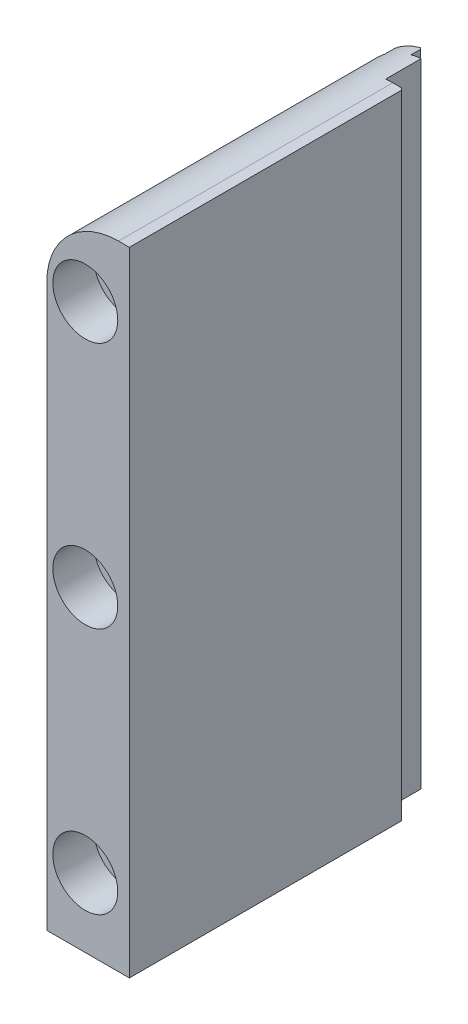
ISO-10303-21;
HEADER;
FILE_DESCRIPTION(('STEP AP214'),'2;1');
FILE_NAME('part.step','',(''),(''),'','','');
FILE_SCHEMA(('AUTOMOTIVE_DESIGN { 1 0 10303 214 1 1 1 1 }'));
ENDSEC;
DATA;
#1=APPLICATION_CONTEXT('core data for automotive mechanical design processes');
#2=APPLICATION_PROTOCOL_DEFINITION('international standard','automotive_design',2000,#1);
#3=PRODUCT_CONTEXT('',#1,'mechanical');
#4=PRODUCT('Part','Part','',(#3));
#5=PRODUCT_RELATED_PRODUCT_CATEGORY('part','',(#4));
#6=PRODUCT_DEFINITION_FORMATION('','',#4);
#7=PRODUCT_DEFINITION_CONTEXT('part definition',#1,'design');
#8=PRODUCT_DEFINITION('design','',#6,#7);
#9=PRODUCT_DEFINITION_SHAPE('','',#8);
#10=(LENGTH_UNIT() NAMED_UNIT(*) SI_UNIT(.MILLI.,.METRE.));
#11=(NAMED_UNIT(*) PLANE_ANGLE_UNIT() SI_UNIT($,.RADIAN.));
#12=(NAMED_UNIT(*) SI_UNIT($,.STERADIAN.) SOLID_ANGLE_UNIT());
#13=UNCERTAINTY_MEASURE_WITH_UNIT(LENGTH_MEASURE(1.E-05),#10,'distance_accuracy_value','');
#14=(GEOMETRIC_REPRESENTATION_CONTEXT(3) GLOBAL_UNCERTAINTY_ASSIGNED_CONTEXT((#13)) GLOBAL_UNIT_ASSIGNED_CONTEXT((#10,
#11,#12)) REPRESENTATION_CONTEXT('',''));
#15=CARTESIAN_POINT('',(0.,0.,0.));
#16=DIRECTION('',(0.,0.,1.));
#17=DIRECTION('',(1.,0.,0.));
#18=AXIS2_PLACEMENT_3D('',#15,#16,#17);
#19=CARTESIAN_POINT('',(-7.32028,42.545,-41.656));
#20=DIRECTION('',(0.,0.,-1.));
#21=DIRECTION('',(1.,0.,0.));
#22=AXIS2_PLACEMENT_3D('',#19,#20,#21);
#23=PLANE('',#22);
#24=CARTESIAN_POINT('',(-5.92328,-33.274,-41.656));
#25=DIRECTION('',(0.,0.,-1.));
#26=DIRECTION('',(-1.,0.,0.));
#27=AXIS2_PLACEMENT_3D('',#24,#25,#26);
#28=CIRCLE('',#27,2.7051);
#29=CARTESIAN_POINT('',(-8.62838,-33.274,-41.656));
#30=VERTEX_POINT('',#29);
#31=EDGE_CURVE('E499',#30,#30,#28,.T.);
#32=ORIENTED_EDGE('',*,*,#31,.F.);
#33=EDGE_LOOP('',(#32));
#34=FACE_BOUND('',#33,.T.);
#35=CARTESIAN_POINT('',(-5.92328,0.,-41.656));
#36=DIRECTION('',(0.,0.,-1.));
#37=DIRECTION('',(-1.,0.,0.));
#38=AXIS2_PLACEMENT_3D('',#35,#36,#37);
#39=CIRCLE('',#38,2.7051);
#40=CARTESIAN_POINT('',(-8.62838,0.,-41.656));
#41=VERTEX_POINT('',#40);
#42=EDGE_CURVE('E502',#41,#41,#39,.T.);
#43=ORIENTED_EDGE('',*,*,#42,.F.);
#44=EDGE_LOOP('',(#43));
#45=FACE_BOUND('',#44,.T.);
#46=CARTESIAN_POINT('',(-5.92328,33.274,-41.656));
#47=DIRECTION('',(0.,0.,-1.));
#48=DIRECTION('',(-1.,0.,0.));
#49=AXIS2_PLACEMENT_3D('',#46,#47,#48);
#50=CIRCLE('',#49,2.7051);
#51=CARTESIAN_POINT('',(-8.62838,33.274,-41.656));
#52=VERTEX_POINT('',#51);
#53=EDGE_CURVE('E506',#52,#52,#50,.T.);
#54=ORIENTED_EDGE('',*,*,#53,.F.);
#55=EDGE_LOOP('',(#54));
#56=FACE_BOUND('',#55,.T.);
#57=DIRECTION('',(-0.999999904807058,0.000436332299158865,0.));
#58=VECTOR('',#57,1.);
#59=CARTESIAN_POINT('',(-7.32432497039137,33.2746113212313,-41.656));
#60=LINE('',#59,#58);
#61=CARTESIAN_POINT('',(-2.74802630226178,33.2726145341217,-41.656));
#62=VERTEX_POINT('',#61);
#63=CARTESIAN_POINT('',(-2.7482803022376,33.2726146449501,-41.656));
#64=VERTEX_POINT('',#63);
#65=EDGE_CURVE('E312',#62,#64,#60,.T.);
#66=ORIENTED_EDGE('',*,*,#65,.T.);
#67=CARTESIAN_POINT('',(-5.92328,33.274,-41.656));
#68=DIRECTION('',(0.,0.,1.));
#69=DIRECTION('',(1.,0.,0.));
#70=AXIS2_PLACEMENT_3D('',#67,#68,#69);
#71=CIRCLE('',#70,3.175);
#72=CARTESIAN_POINT('',(-2.74828,33.274,-41.656));
#73=VERTEX_POINT('',#72);
#74=EDGE_CURVE('E496',#73,#64,#71,.T.);
#75=ORIENTED_EDGE('',*,*,#74,.F.);
#76=DIRECTION('',(-1.,0.,0.));
#77=VECTOR('',#76,1.);
#78=CARTESIAN_POINT('',(-7.32028,33.274,-41.656));
#79=LINE('',#78,#77);
#80=CARTESIAN_POINT('',(-2.748026,33.274,-41.656));
#81=VERTEX_POINT('',#80);
#82=EDGE_CURVE('E395',#73,#81,#79,.F.);
#83=ORIENTED_EDGE('',*,*,#82,.T.);
#84=CARTESIAN_POINT('',(-5.92328,33.274,-41.656));
#85=DIRECTION('',(0.,0.,-1.));
#86=DIRECTION('',(-1.,0.,0.));
#87=AXIS2_PLACEMENT_3D('',#84,#85,#86);
#88=CIRCLE('',#87,3.175254);
#89=CARTESIAN_POINT('',(-3.76428,35.6022948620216,-41.656));
#90=VERTEX_POINT('',#89);
#91=EDGE_CURVE('E733',#90,#81,#88,.T.);
#92=ORIENTED_EDGE('',*,*,#91,.F.);
#93=DIRECTION('',(0.,-1.,0.));
#94=VECTOR('',#93,1.);
#95=CARTESIAN_POINT('',(-3.76428,42.545,-41.656));
#96=LINE('',#95,#94);
#97=CARTESIAN_POINT('',(-3.76428,42.2641543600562,-41.656));
#98=VERTEX_POINT('',#97);
#99=EDGE_CURVE('E321',#98,#90,#96,.T.);
#100=ORIENTED_EDGE('',*,*,#99,.F.);
#101=CARTESIAN_POINT('',(-1.45288000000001,32.893,-41.656));
#102=DIRECTION('',(0.,0.,1.));
#103=DIRECTION('',(1.,0.,0.));
#104=AXIS2_PLACEMENT_3D('',#101,#102,#103);
#105=CIRCLE('',#104,9.652);
#106=CARTESIAN_POINT('',(-2.40538,42.4978866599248,-41.656));
#107=VERTEX_POINT('',#106);
#108=EDGE_CURVE('E549',#107,#98,#105,.T.);
#109=ORIENTED_EDGE('',*,*,#108,.F.);
#110=DIRECTION('',(0.,-1.,0.));
#111=VECTOR('',#110,1.);
#112=CARTESIAN_POINT('',(-2.40538,42.545,-41.656));
#113=LINE('',#112,#111);
#114=CARTESIAN_POINT('',(-2.40538,-42.545,-41.656));
#115=VERTEX_POINT('',#114);
#116=EDGE_CURVE('E566',#107,#115,#113,.T.);
#117=ORIENTED_EDGE('',*,*,#116,.T.);
#118=DIRECTION('',(-1.,0.,0.));
#119=VECTOR('',#118,1.);
#120=CARTESIAN_POINT('',(-2.34188,-42.545,-41.656));
#121=LINE('',#120,#119);
#122=CARTESIAN_POINT('',(-3.76428,-42.545,-41.656));
#123=VERTEX_POINT('',#122);
#124=EDGE_CURVE('E513',#115,#123,#121,.T.);
#125=ORIENTED_EDGE('',*,*,#124,.T.);
#126=CARTESIAN_POINT('',(-3.76428,-35.6022948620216,-41.656));
#127=VERTEX_POINT('',#126);
#128=EDGE_CURVE('E336',#127,#123,#96,.T.);
#129=ORIENTED_EDGE('',*,*,#128,.F.);
#130=CARTESIAN_POINT('',(-5.92328,-33.274,-41.656));
#131=DIRECTION('',(0.,0.,-1.));
#132=DIRECTION('',(-1.,0.,0.));
#133=AXIS2_PLACEMENT_3D('',#130,#131,#132);
#134=CIRCLE('',#133,3.175254);
#135=CARTESIAN_POINT('',(-2.74802630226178,-33.2753854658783,-41.656));
#136=VERTEX_POINT('',#135);
#137=EDGE_CURVE('E452',#136,#127,#134,.T.);
#138=ORIENTED_EDGE('',*,*,#137,.F.);
#139=DIRECTION('',(-0.999999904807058,0.00043633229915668,0.));
#140=VECTOR('',#139,1.);
#141=CARTESIAN_POINT('',(-7.3533620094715,-33.2733760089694,-41.656));
#142=LINE('',#141,#140);
#143=CARTESIAN_POINT('',(-2.7482803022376,-33.2753853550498,-41.656));
#144=VERTEX_POINT('',#143);
#145=EDGE_CURVE('E471',#136,#144,#142,.T.);
#146=ORIENTED_EDGE('',*,*,#145,.T.);
#147=CARTESIAN_POINT('',(-5.92328,-33.274,-41.656));
#148=DIRECTION('',(0.,0.,1.));
#149=DIRECTION('',(1.,0.,0.));
#150=AXIS2_PLACEMENT_3D('',#147,#148,#149);
#151=CIRCLE('',#150,3.175);
#152=CARTESIAN_POINT('',(-2.74828,-33.274,-41.656));
#153=VERTEX_POINT('',#152);
#154=EDGE_CURVE('E491',#153,#144,#151,.T.);
#155=ORIENTED_EDGE('',*,*,#154,.F.);
#156=DIRECTION('',(-1.,0.,0.));
#157=VECTOR('',#156,1.);
#158=CARTESIAN_POINT('',(-7.32028,-33.274,-41.656));
#159=LINE('',#158,#157);
#160=CARTESIAN_POINT('',(-2.748026,-33.274,-41.656));
#161=VERTEX_POINT('',#160);
#162=EDGE_CURVE('E474',#153,#161,#159,.F.);
#163=ORIENTED_EDGE('',*,*,#162,.T.);
#164=CARTESIAN_POINT('',(-3.76428,-30.9457051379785,-41.656));
#165=VERTEX_POINT('',#164);
#166=EDGE_CURVE('E455',#165,#161,#134,.T.);
#167=ORIENTED_EDGE('',*,*,#166,.F.);
#168=CARTESIAN_POINT('',(-3.76428,-2.32829486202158,-41.656));
#169=VERTEX_POINT('',#168);
#170=EDGE_CURVE('E322',#169,#165,#96,.T.);
#171=ORIENTED_EDGE('',*,*,#170,.F.);
#172=CARTESIAN_POINT('',(-5.92328,0.,-41.656));
#173=DIRECTION('',(0.,0.,-1.));
#174=DIRECTION('',(-1.,0.,0.));
#175=AXIS2_PLACEMENT_3D('',#172,#173,#174);
#176=CIRCLE('',#175,3.175254);
#177=CARTESIAN_POINT('',(-2.74802630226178,-0.00138546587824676,-41.656));
#178=VERTEX_POINT('',#177);
#179=EDGE_CURVE('E414',#178,#169,#176,.T.);
#180=ORIENTED_EDGE('',*,*,#179,.F.);
#181=DIRECTION('',(-0.999999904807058,0.000436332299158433,0.));
#182=VECTOR('',#181,1.);
#183=CARTESIAN_POINT('',(-7.3388434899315,0.000617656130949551,-41.656));
#184=LINE('',#183,#182);
#185=CARTESIAN_POINT('',(-2.7482803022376,-0.00138535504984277,-41.656));
#186=VERTEX_POINT('',#185);
#187=EDGE_CURVE('E394',#178,#186,#184,.T.);
#188=ORIENTED_EDGE('',*,*,#187,.T.);
#189=CARTESIAN_POINT('',(-5.92328,0.,-41.656));
#190=DIRECTION('',(0.,0.,1.));
#191=DIRECTION('',(1.,0.,0.));
#192=AXIS2_PLACEMENT_3D('',#189,#190,#191);
#193=CIRCLE('',#192,3.175);
#194=CARTESIAN_POINT('',(-2.74828,0.,-41.656));
#195=VERTEX_POINT('',#194);
#196=EDGE_CURVE('E493',#195,#186,#193,.T.);
#197=ORIENTED_EDGE('',*,*,#196,.F.);
#198=DIRECTION('',(-1.,0.,0.));
#199=VECTOR('',#198,1.);
#200=CARTESIAN_POINT('',(-7.32028,0.,-41.656));
#201=LINE('',#200,#199);
#202=CARTESIAN_POINT('',(-2.748026,0.,-41.656));
#203=VERTEX_POINT('',#202);
#204=EDGE_CURVE('E380',#195,#203,#201,.F.);
#205=ORIENTED_EDGE('',*,*,#204,.T.);
#206=CARTESIAN_POINT('',(-3.76428,2.32829486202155,-41.656));
#207=VERTEX_POINT('',#206);
#208=EDGE_CURVE('E415',#207,#203,#176,.T.);
#209=ORIENTED_EDGE('',*,*,#208,.F.);
#210=CARTESIAN_POINT('',(-3.76428,30.9457051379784,-41.656));
#211=VERTEX_POINT('',#210);
#212=EDGE_CURVE('E319',#211,#207,#96,.T.);
#213=ORIENTED_EDGE('',*,*,#212,.F.);
#214=EDGE_CURVE('E793',#62,#211,#88,.T.);
#215=ORIENTED_EDGE('',*,*,#214,.F.);
#216=EDGE_LOOP('',(#66,#75,#83,#92,#100,#109,#117,#125,#129,#138,#146,#155,#163,#167,#171,#180,
#188,#197,#205,#209,#213,#215));
#217=FACE_BOUND('',#216,.T.);
#218=ADVANCED_FACE('F15',(#34,#45,#56,#217),#23,.T.);
#219=CARTESIAN_POINT('',(-5.92328,33.274,-31.2166));
#220=DIRECTION('',(0.,0.,1.));
#221=DIRECTION('',(1.,0.,0.));
#222=AXIS2_PLACEMENT_3D('',#219,#220,#221);
#223=CONICAL_SURFACE('',#222,3.3147,0.785398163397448);
#224=CARTESIAN_POINT('',(-5.92328,33.274,-31.8262));
#225=DIRECTION('',(0.,0.,1.));
#226=DIRECTION('',(1.,0.,0.));
#227=AXIS2_PLACEMENT_3D('',#224,#225,#226);
#228=CIRCLE('',#227,2.7051);
#229=CARTESIAN_POINT('',(-3.21818,33.274,-31.8262));
#230=VERTEX_POINT('',#229);
#231=EDGE_CURVE('E494',#230,#230,#228,.T.);
#232=ORIENTED_EDGE('',*,*,#231,.F.);
#233=EDGE_LOOP('',(#232));
#234=FACE_BOUND('',#233,.T.);
#235=CARTESIAN_POINT('',(-5.92328,33.274,-31.2166));
#236=DIRECTION('',(0.,0.,-1.));
#237=DIRECTION('',(-1.,0.,0.));
#238=AXIS2_PLACEMENT_3D('',#235,#236,#237);
#239=CIRCLE('',#238,3.3147);
#240=CARTESIAN_POINT('',(-9.23798,33.274,-31.2166));
#241=VERTEX_POINT('',#240);
#242=EDGE_CURVE('E486',#241,#241,#239,.T.);
#243=ORIENTED_EDGE('',*,*,#242,.F.);
#244=EDGE_LOOP('',(#243));
#245=FACE_BOUND('',#244,.T.);
#246=CARTESIAN_POINT('',(-5.92328,33.274,-31.3563));
#247=DIRECTION('',(0.,0.,1.));
#248=DIRECTION('',(1.,0.,0.));
#249=AXIS2_PLACEMENT_3D('',#246,#247,#248);
#250=CIRCLE('',#249,3.175);
#251=CARTESIAN_POINT('',(-2.7482803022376,33.2726146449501,-31.3563));
#252=VERTEX_POINT('',#251);
#253=CARTESIAN_POINT('',(-2.74828,33.274,-31.3563));
#254=VERTEX_POINT('',#253);
#255=EDGE_CURVE('E9',#252,#254,#250,.F.);
#256=ORIENTED_EDGE('',*,*,#255,.F.);
#257=DIRECTION('',(0.707106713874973,-0.000308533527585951,0.707106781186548));
#258=VECTOR('',#257,1.);
#259=CARTESIAN_POINT('',(-5.92328,33.274,-34.5313));
#260=LINE('',#259,#258);
#261=CARTESIAN_POINT('',(-2.74802630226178,33.2726145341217,-31.356046));
#262=VERTEX_POINT('',#261);
#263=EDGE_CURVE('E304',#262,#252,#260,.F.);
#264=ORIENTED_EDGE('',*,*,#263,.F.);
#265=CARTESIAN_POINT('',(-5.92328,33.274,-31.356046));
#266=DIRECTION('',(0.,0.,1.));
#267=DIRECTION('',(1.,0.,0.));
#268=AXIS2_PLACEMENT_3D('',#265,#266,#267);
#269=CIRCLE('',#268,3.175254);
#270=CARTESIAN_POINT('',(-2.748026,33.274,-31.356046));
#271=VERTEX_POINT('',#270);
#272=EDGE_CURVE('E296',#262,#271,#269,.F.);
#273=ORIENTED_EDGE('',*,*,#272,.T.);
#274=DIRECTION('',(0.707106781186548,0.,0.707106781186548));
#275=VECTOR('',#274,1.);
#276=CARTESIAN_POINT('',(-5.92328,33.274,-34.5313));
#277=LINE('',#276,#275);
#278=EDGE_CURVE('E25',#254,#271,#277,.T.);
#279=ORIENTED_EDGE('',*,*,#278,.F.);
#280=EDGE_LOOP('',(#256,#264,#273,#279));
#281=FACE_BOUND('',#280,.T.);
#282=ADVANCED_FACE('F315',(#234,#245,#281),#223,.F.);
#283=CARTESIAN_POINT('',(-7.32028,30.4225742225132,-41.656));
#284=VERTEX_POINT('',#283);
#285=CARTESIAN_POINT('',(-7.32028,36.1254257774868,-41.656));
#286=VERTEX_POINT('',#285);
#287=EDGE_CURVE('E789',#284,#286,#88,.T.);
#288=ORIENTED_EDGE('',*,*,#287,.F.);
#289=DIRECTION('',(0.,-1.,0.));
#290=VECTOR('',#289,1.);
#291=CARTESIAN_POINT('',(-7.32028,42.545,-41.656));
#292=LINE('',#291,#290);
#293=CARTESIAN_POINT('',(-7.32028,2.85142577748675,-41.656));
#294=VERTEX_POINT('',#293);
#295=EDGE_CURVE('E19',#284,#294,#292,.T.);
#296=ORIENTED_EDGE('',*,*,#295,.T.);
#297=CARTESIAN_POINT('',(-7.32028,-2.85142577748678,-41.656));
#298=VERTEX_POINT('',#297);
#299=EDGE_CURVE('E410',#298,#294,#176,.T.);
#300=ORIENTED_EDGE('',*,*,#299,.F.);
#301=CARTESIAN_POINT('',(-7.32028,-30.4225742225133,-41.656));
#302=VERTEX_POINT('',#301);
#303=EDGE_CURVE('E342',#298,#302,#292,.T.);
#304=ORIENTED_EDGE('',*,*,#303,.T.);
#305=CARTESIAN_POINT('',(-7.32028,-36.1254257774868,-41.656));
#306=VERTEX_POINT('',#305);
#307=EDGE_CURVE('E456',#306,#302,#134,.T.);
#308=ORIENTED_EDGE('',*,*,#307,.F.);
#309=CARTESIAN_POINT('',(-7.32028,-42.545,-41.656));
#310=VERTEX_POINT('',#309);
#311=EDGE_CURVE('E343',#306,#310,#292,.T.);
#312=ORIENTED_EDGE('',*,*,#311,.T.);
#313=DIRECTION('',(-1.,0.,0.));
#314=VECTOR('',#313,1.);
#315=CARTESIAN_POINT('',(-7.32028,-42.545,-41.656));
#316=LINE('',#315,#314);
#317=CARTESIAN_POINT('',(-11.10488,-42.545,-41.656));
#318=VERTEX_POINT('',#317);
#319=EDGE_CURVE('E524',#310,#318,#316,.T.);
#320=ORIENTED_EDGE('',*,*,#319,.T.);
#321=DIRECTION('',(0.,-1.,0.));
#322=VECTOR('',#321,1.);
#323=CARTESIAN_POINT('',(-11.10488,42.545,-41.656));
#324=LINE('',#323,#322);
#325=CARTESIAN_POINT('',(-11.10488,32.893,-41.656));
#326=VERTEX_POINT('',#325);
#327=EDGE_CURVE('E350',#326,#318,#324,.T.);
#328=ORIENTED_EDGE('',*,*,#327,.F.);
#329=CARTESIAN_POINT('',(-1.45288000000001,32.893,-41.656));
#330=DIRECTION('',(0.,0.,1.));
#331=DIRECTION('',(1.,0.,0.));
#332=AXIS2_PLACEMENT_3D('',#329,#330,#331);
#333=CIRCLE('',#332,9.652);
#334=CARTESIAN_POINT('',(-7.32028,40.5568581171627,-41.656));
#335=VERTEX_POINT('',#334);
#336=EDGE_CURVE('E538',#335,#326,#333,.T.);
#337=ORIENTED_EDGE('',*,*,#336,.F.);
#338=EDGE_CURVE('E349',#335,#286,#292,.T.);
#339=ORIENTED_EDGE('',*,*,#338,.T.);
#340=EDGE_LOOP('',(#288,#296,#300,#304,#308,#312,#320,#328,#337,#339));
#341=FACE_BOUND('',#340,.T.);
#342=ADVANCED_FACE('F706',(#341),#23,.T.);
#343=CARTESIAN_POINT('',(-5.92328,0.,-31.2166));
#344=DIRECTION('',(0.,0.,1.));
#345=DIRECTION('',(1.,0.,0.));
#346=AXIS2_PLACEMENT_3D('',#343,#344,#345);
#347=CONICAL_SURFACE('',#346,3.3147,0.785398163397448);
#348=CARTESIAN_POINT('',(-5.92328,0.,-31.8262));
#349=DIRECTION('',(0.,0.,1.));
#350=DIRECTION('',(1.,0.,0.));
#351=AXIS2_PLACEMENT_3D('',#348,#349,#350);
#352=CIRCLE('',#351,2.7051);
#353=CARTESIAN_POINT('',(-3.21818,0.,-31.8262));
#354=VERTEX_POINT('',#353);
#355=EDGE_CURVE('E490',#354,#354,#352,.T.);
#356=ORIENTED_EDGE('',*,*,#355,.F.);
#357=EDGE_LOOP('',(#356));
#358=FACE_BOUND('',#357,.T.);
#359=CARTESIAN_POINT('',(-5.92328,0.,-31.2166));
#360=DIRECTION('',(0.,0.,-1.));
#361=DIRECTION('',(-1.,0.,0.));
#362=AXIS2_PLACEMENT_3D('',#359,#360,#361);
#363=CIRCLE('',#362,3.3147);
#364=CARTESIAN_POINT('',(-9.23798,0.,-31.2166));
#365=VERTEX_POINT('',#364);
#366=EDGE_CURVE('E481',#365,#365,#363,.T.);
#367=ORIENTED_EDGE('',*,*,#366,.F.);
#368=EDGE_LOOP('',(#367));
#369=FACE_BOUND('',#368,.T.);
#370=CARTESIAN_POINT('',(-5.92328,0.,-31.3563));
#371=DIRECTION('',(0.,0.,1.));
#372=DIRECTION('',(1.,0.,0.));
#373=AXIS2_PLACEMENT_3D('',#370,#371,#372);
#374=CIRCLE('',#373,3.175);
#375=CARTESIAN_POINT('',(-2.7482803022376,-0.00138535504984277,-31.3563));
#376=VERTEX_POINT('',#375);
#377=CARTESIAN_POINT('',(-2.74828,0.,-31.3563));
#378=VERTEX_POINT('',#377);
#379=EDGE_CURVE('E305',#376,#378,#374,.F.);
#380=ORIENTED_EDGE('',*,*,#379,.F.);
#381=DIRECTION('',(0.707106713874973,-0.000308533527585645,0.707106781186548));
#382=VECTOR('',#381,1.);
#383=CARTESIAN_POINT('',(-5.92328,0.,-34.5313));
#384=LINE('',#383,#382);
#385=CARTESIAN_POINT('',(-2.74802630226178,-0.00138546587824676,-31.356046));
#386=VERTEX_POINT('',#385);
#387=EDGE_CURVE('E359',#386,#376,#384,.F.);
#388=ORIENTED_EDGE('',*,*,#387,.F.);
#389=CARTESIAN_POINT('',(-5.92328,0.,-31.356046));
#390=DIRECTION('',(0.,0.,1.));
#391=DIRECTION('',(1.,0.,0.));
#392=AXIS2_PLACEMENT_3D('',#389,#390,#391);
#393=CIRCLE('',#392,3.175254);
#394=CARTESIAN_POINT('',(-2.748026,0.,-31.356046));
#395=VERTEX_POINT('',#394);
#396=EDGE_CURVE('E356',#386,#395,#393,.F.);
#397=ORIENTED_EDGE('',*,*,#396,.T.);
#398=DIRECTION('',(0.707106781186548,0.,0.707106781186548));
#399=VECTOR('',#398,1.);
#400=CARTESIAN_POINT('',(-5.92328,0.,-34.5313));
#401=LINE('',#400,#399);
#402=EDGE_CURVE('E361',#378,#395,#401,.T.);
#403=ORIENTED_EDGE('',*,*,#402,.F.);
#404=EDGE_LOOP('',(#380,#388,#397,#403));
#405=FACE_BOUND('',#404,.T.);
#406=ADVANCED_FACE('F383',(#358,#369,#405),#347,.F.);
#407=CARTESIAN_POINT('',(-5.92328,-33.274,-31.2166));
#408=DIRECTION('',(0.,0.,1.));
#409=DIRECTION('',(1.,0.,0.));
#410=AXIS2_PLACEMENT_3D('',#407,#408,#409);
#411=CONICAL_SURFACE('',#410,3.3147,0.785398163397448);
#412=CARTESIAN_POINT('',(-5.92328,-33.274,-31.8262));
#413=DIRECTION('',(0.,0.,1.));
#414=DIRECTION('',(1.,0.,0.));
#415=AXIS2_PLACEMENT_3D('',#412,#413,#414);
#416=CIRCLE('',#415,2.7051);
#417=CARTESIAN_POINT('',(-3.21818,-33.274,-31.8262));
#418=VERTEX_POINT('',#417);
#419=EDGE_CURVE('E485',#418,#418,#416,.T.);
#420=ORIENTED_EDGE('',*,*,#419,.F.);
#421=EDGE_LOOP('',(#420));
#422=FACE_BOUND('',#421,.T.);
#423=CARTESIAN_POINT('',(-5.92328,-33.274,-31.2166));
#424=DIRECTION('',(0.,0.,-1.));
#425=DIRECTION('',(-1.,0.,0.));
#426=AXIS2_PLACEMENT_3D('',#423,#424,#425);
#427=CIRCLE('',#426,3.3147);
#428=CARTESIAN_POINT('',(-9.23798,-33.274,-31.2166));
#429=VERTEX_POINT('',#428);
#430=EDGE_CURVE('E477',#429,#429,#427,.T.);
#431=ORIENTED_EDGE('',*,*,#430,.F.);
#432=EDGE_LOOP('',(#431));
#433=FACE_BOUND('',#432,.T.);
#434=CARTESIAN_POINT('',(-5.92328,-33.274,-31.3563));
#435=DIRECTION('',(0.,0.,1.));
#436=DIRECTION('',(1.,0.,0.));
#437=AXIS2_PLACEMENT_3D('',#434,#435,#436);
#438=CIRCLE('',#437,3.175);
#439=CARTESIAN_POINT('',(-2.7482803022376,-33.2753853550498,-31.3563));
#440=VERTEX_POINT('',#439);
#441=CARTESIAN_POINT('',(-2.74828,-33.274,-31.3563));
#442=VERTEX_POINT('',#441);
#443=EDGE_CURVE('E360',#440,#442,#438,.F.);
#444=ORIENTED_EDGE('',*,*,#443,.F.);
#445=DIRECTION('',(0.707106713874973,-0.000308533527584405,0.707106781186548));
#446=VECTOR('',#445,1.);
#447=CARTESIAN_POINT('',(-5.92328,-33.274,-34.5313));
#448=LINE('',#447,#446);
#449=CARTESIAN_POINT('',(-2.74802630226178,-33.2753854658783,-31.356046));
#450=VERTEX_POINT('',#449);
#451=EDGE_CURVE('E651',#450,#440,#448,.F.);
#452=ORIENTED_EDGE('',*,*,#451,.F.);
#453=CARTESIAN_POINT('',(-5.92328,-33.274,-31.356046));
#454=DIRECTION('',(0.,0.,1.));
#455=DIRECTION('',(1.,0.,0.));
#456=AXIS2_PLACEMENT_3D('',#453,#454,#455);
#457=CIRCLE('',#456,3.175254);
#458=CARTESIAN_POINT('',(-2.748026,-33.274,-31.356046));
#459=VERTEX_POINT('',#458);
#460=EDGE_CURVE('E604',#450,#459,#457,.F.);
#461=ORIENTED_EDGE('',*,*,#460,.T.);
#462=DIRECTION('',(0.707106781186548,0.,0.707106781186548));
#463=VECTOR('',#462,1.);
#464=CARTESIAN_POINT('',(-5.92328,-33.274,-34.5313));
#465=LINE('',#464,#463);
#466=EDGE_CURVE('E653',#442,#459,#465,.T.);
#467=ORIENTED_EDGE('',*,*,#466,.F.);
#468=EDGE_LOOP('',(#444,#452,#461,#467));
#469=FACE_BOUND('',#468,.T.);
#470=ADVANCED_FACE('F666',(#422,#433,#469),#411,.F.);
#471=CARTESIAN_POINT('',(-3.76428,42.545,-41.656));
#472=DIRECTION('',(1.,0.,0.));
#473=DIRECTION('',(0.,0.,1.));
#474=AXIS2_PLACEMENT_3D('',#471,#472,#473);
#475=PLANE('',#474);
#476=DIRECTION('',(0.,0.,1.));
#477=VECTOR('',#476,1.);
#478=CARTESIAN_POINT('',(-3.76428,-35.6022948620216,-31.2166));
#479=LINE('',#478,#477);
#480=CARTESIAN_POINT('',(-3.76428,-35.6022948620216,-42.926));
#481=VERTEX_POINT('',#480);
#482=EDGE_CURVE('E450',#127,#481,#479,.F.);
#483=ORIENTED_EDGE('',*,*,#482,.F.);
#484=ORIENTED_EDGE('',*,*,#128,.T.);
#485=DIRECTION('',(0.,0.,-1.));
#486=VECTOR('',#485,1.);
#487=CARTESIAN_POINT('',(-3.76428,-42.545,-41.656));
#488=LINE('',#487,#486);
#489=CARTESIAN_POINT('',(-3.76428,-42.545,-42.926));
#490=VERTEX_POINT('',#489);
#491=EDGE_CURVE('E516',#123,#490,#488,.T.);
#492=ORIENTED_EDGE('',*,*,#491,.T.);
#493=DIRECTION('',(0.,1.,0.));
#494=VECTOR('',#493,1.);
#495=CARTESIAN_POINT('',(-3.76428,42.545,-42.926));
#496=LINE('',#495,#494);
#497=EDGE_CURVE('E592',#490,#481,#496,.T.);
#498=ORIENTED_EDGE('',*,*,#497,.T.);
#499=EDGE_LOOP('',(#483,#484,#492,#498));
#500=FACE_BOUND('',#499,.T.);
#501=ADVANCED_FACE('F678',(#500),#475,.T.);
#502=CARTESIAN_POINT('',(-7.32028,42.545,-42.926));
#503=DIRECTION('',(0.707106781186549,0.,0.707106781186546));
#504=DIRECTION('',(0.707106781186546,0.,-0.707106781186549));
#505=AXIS2_PLACEMENT_3D('',#502,#503,#504);
#506=PLANE('',#505);
#507=CARTESIAN_POINT('',(-5.92328,-33.274,-44.323));
#508=DIRECTION('',(0.707106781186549,0.,0.707106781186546));
#509=DIRECTION('',(-0.707106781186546,0.,0.707106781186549));
#510=AXIS2_PLACEMENT_3D('',#507,#508,#509);
#511=ELLIPSE('',#510,4.49048727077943,3.175254);
#512=CARTESIAN_POINT('',(-7.06628,-36.236395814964,-43.18));
#513=VERTEX_POINT('',#512);
#514=CARTESIAN_POINT('',(-7.32028,-36.1254257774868,-42.926));
#515=VERTEX_POINT('',#514);
#516=EDGE_CURVE('E448',#513,#515,#511,.F.);
#517=ORIENTED_EDGE('',*,*,#516,.F.);
#518=DIRECTION('',(0.,1.,0.));
#519=VECTOR('',#518,1.);
#520=CARTESIAN_POINT('',(-7.06628,42.545,-43.18));
#521=LINE('',#520,#519);
#522=CARTESIAN_POINT('',(-7.06628,-42.545,-43.18));
#523=VERTEX_POINT('',#522);
#524=EDGE_CURVE('E582',#523,#513,#521,.T.);
#525=ORIENTED_EDGE('',*,*,#524,.F.);
#526=DIRECTION('',(-0.707106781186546,0.,0.707106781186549));
#527=VECTOR('',#526,1.);
#528=CARTESIAN_POINT('',(-7.32028,-42.545,-42.926));
#529=LINE('',#528,#527);
#530=CARTESIAN_POINT('',(-7.32028,-42.545,-42.926));
#531=VERTEX_POINT('',#530);
#532=EDGE_CURVE('E571',#531,#523,#529,.F.);
#533=ORIENTED_EDGE('',*,*,#532,.F.);
#534=DIRECTION('',(0.,-1.,0.));
#535=VECTOR('',#534,1.);
#536=CARTESIAN_POINT('',(-7.32028,42.545,-42.926));
#537=LINE('',#536,#535);
#538=EDGE_CURVE('E600',#515,#531,#537,.T.);
#539=ORIENTED_EDGE('',*,*,#538,.F.);
#540=EDGE_LOOP('',(#517,#525,#533,#539));
#541=FACE_BOUND('',#540,.T.);
#542=ADVANCED_FACE('F693',(#541),#506,.F.);
#543=CARTESIAN_POINT('',(-3.76428,42.545,-43.18));
#544=DIRECTION('',(0.,0.,-1.));
#545=DIRECTION('',(1.,0.,0.));
#546=AXIS2_PLACEMENT_3D('',#543,#544,#545);
#547=PLANE('',#546);
#548=CARTESIAN_POINT('',(-5.92328,0.,-43.18));
#549=DIRECTION('',(0.,0.,-1.));
#550=DIRECTION('',(-1.,0.,0.));
#551=AXIS2_PLACEMENT_3D('',#548,#549,#550);
#552=CIRCLE('',#551,3.175254);
#553=CARTESIAN_POINT('',(-4.01828,-2.54031749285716,-43.18));
#554=VERTEX_POINT('',#553);
#555=CARTESIAN_POINT('',(-7.06628,-2.96239581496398,-43.18));
#556=VERTEX_POINT('',#555);
#557=EDGE_CURVE('E424',#554,#556,#552,.T.);
#558=ORIENTED_EDGE('',*,*,#557,.F.);
#559=DIRECTION('',(0.,-1.,0.));
#560=VECTOR('',#559,1.);
#561=CARTESIAN_POINT('',(-4.01828,42.545,-43.18));
#562=LINE('',#561,#560);
#563=CARTESIAN_POINT('',(-4.01828,-30.7336825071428,-43.18));
#564=VERTEX_POINT('',#563);
#565=EDGE_CURVE('E759',#554,#564,#562,.T.);
#566=ORIENTED_EDGE('',*,*,#565,.T.);
#567=CARTESIAN_POINT('',(-5.92328,-33.274,-43.18));
#568=DIRECTION('',(0.,0.,-1.));
#569=DIRECTION('',(-1.,0.,0.));
#570=AXIS2_PLACEMENT_3D('',#567,#568,#569);
#571=CIRCLE('',#570,3.175254);
#572=CARTESIAN_POINT('',(-7.06628,-30.3116041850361,-43.18));
#573=VERTEX_POINT('',#572);
#574=EDGE_CURVE('E463',#573,#564,#571,.T.);
#575=ORIENTED_EDGE('',*,*,#574,.F.);
#576=EDGE_CURVE('E586',#573,#556,#521,.T.);
#577=ORIENTED_EDGE('',*,*,#576,.T.);
#578=EDGE_LOOP('',(#558,#566,#575,#577));
#579=FACE_BOUND('',#578,.T.);
#580=ADVANCED_FACE('F764',(#579),#547,.T.);
#581=CARTESIAN_POINT('',(-7.32028,42.545,-43.18));
#582=DIRECTION('',(-1.,0.,0.));
#583=DIRECTION('',(0.,0.,-1.));
#584=AXIS2_PLACEMENT_3D('',#581,#582,#583);
#585=PLANE('',#584);
#586=DIRECTION('',(0.,0.,1.));
#587=VECTOR('',#586,1.);
#588=CARTESIAN_POINT('',(-7.32028,-2.85142577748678,-31.2166));
#589=LINE('',#588,#587);
#590=CARTESIAN_POINT('',(-7.32028,-2.85142577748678,-42.926));
#591=VERTEX_POINT('',#590);
#592=EDGE_CURVE('E417',#591,#298,#589,.T.);
#593=ORIENTED_EDGE('',*,*,#592,.F.);
#594=CARTESIAN_POINT('',(-7.32028,-30.4225742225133,-42.926));
#595=VERTEX_POINT('',#594);
#596=EDGE_CURVE('E926',#591,#595,#537,.T.);
#597=ORIENTED_EDGE('',*,*,#596,.T.);
#598=DIRECTION('',(0.,0.,1.));
#599=VECTOR('',#598,1.);
#600=CARTESIAN_POINT('',(-7.32028,-30.4225742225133,-31.2166));
#601=LINE('',#600,#599);
#602=EDGE_CURVE('E458',#302,#595,#601,.F.);
#603=ORIENTED_EDGE('',*,*,#602,.F.);
#604=ORIENTED_EDGE('',*,*,#303,.F.);
#605=EDGE_LOOP('',(#593,#597,#603,#604));
#606=FACE_BOUND('',#605,.T.);
#607=ADVANCED_FACE('F916',(#606),#585,.T.);
#608=CARTESIAN_POINT('',(-4.01828,42.545,-43.18));
#609=DIRECTION('',(-0.707106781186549,0.,0.707106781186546));
#610=DIRECTION('',(0.707106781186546,0.,0.707106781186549));
#611=AXIS2_PLACEMENT_3D('',#608,#609,#610);
#612=PLANE('',#611);
#613=CARTESIAN_POINT('',(-5.92328,0.,-45.085));
#614=DIRECTION('',(-0.707106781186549,0.,0.707106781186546));
#615=DIRECTION('',(0.707106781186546,0.,0.707106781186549));
#616=AXIS2_PLACEMENT_3D('',#613,#614,#615);
#617=ELLIPSE('',#616,4.49048727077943,3.175254);
#618=CARTESIAN_POINT('',(-3.76428,-2.32829486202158,-42.926));
#619=VERTEX_POINT('',#618);
#620=EDGE_CURVE('E426',#619,#554,#617,.F.);
#621=ORIENTED_EDGE('',*,*,#620,.F.);
#622=CARTESIAN_POINT('',(-3.76428,-30.9457051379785,-42.926));
#623=VERTEX_POINT('',#622);
#624=EDGE_CURVE('E596',#623,#619,#496,.T.);
#625=ORIENTED_EDGE('',*,*,#624,.F.);
#626=CARTESIAN_POINT('',(-5.92328,-33.274,-45.085));
#627=DIRECTION('',(-0.707106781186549,0.,0.707106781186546));
#628=DIRECTION('',(0.707106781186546,0.,0.707106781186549));
#629=AXIS2_PLACEMENT_3D('',#626,#627,#628);
#630=ELLIPSE('',#629,4.49048727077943,3.175254);
#631=EDGE_CURVE('E466',#564,#623,#630,.F.);
#632=ORIENTED_EDGE('',*,*,#631,.F.);
#633=ORIENTED_EDGE('',*,*,#565,.F.);
#634=EDGE_LOOP('',(#621,#625,#632,#633));
#635=FACE_BOUND('',#634,.T.);
#636=ADVANCED_FACE('F757',(#635),#612,.F.);
#637=DIRECTION('',(0.,0.,1.));
#638=VECTOR('',#637,1.);
#639=CARTESIAN_POINT('',(-3.76428,-2.32829486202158,-31.2166));
#640=LINE('',#639,#638);
#641=EDGE_CURVE('E428',#169,#619,#640,.F.);
#642=ORIENTED_EDGE('',*,*,#641,.F.);
#643=ORIENTED_EDGE('',*,*,#170,.T.);
#644=DIRECTION('',(0.,0.,1.));
#645=VECTOR('',#644,1.);
#646=CARTESIAN_POINT('',(-3.76428,-30.9457051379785,-31.2166));
#647=LINE('',#646,#645);
#648=EDGE_CURVE('E468',#623,#165,#647,.T.);
#649=ORIENTED_EDGE('',*,*,#648,.F.);
#650=ORIENTED_EDGE('',*,*,#624,.T.);
#651=EDGE_LOOP('',(#642,#643,#649,#650));
#652=FACE_BOUND('',#651,.T.);
#653=ADVANCED_FACE('F752',(#652),#475,.T.);
#654=CARTESIAN_POINT('',(-5.92328,0.,-44.323));
#655=DIRECTION('',(0.707106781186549,0.,0.707106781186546));
#656=DIRECTION('',(-0.707106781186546,0.,0.707106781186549));
#657=AXIS2_PLACEMENT_3D('',#654,#655,#656);
#658=ELLIPSE('',#657,4.49048727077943,3.175254);
#659=EDGE_CURVE('E422',#556,#591,#658,.F.);
#660=ORIENTED_EDGE('',*,*,#659,.F.);
#661=ORIENTED_EDGE('',*,*,#576,.F.);
#662=CARTESIAN_POINT('',(-5.92328,-33.274,-44.323));
#663=DIRECTION('',(0.707106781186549,0.,0.707106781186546));
#664=DIRECTION('',(-0.707106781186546,0.,0.707106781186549));
#665=AXIS2_PLACEMENT_3D('',#662,#663,#664);
#666=ELLIPSE('',#665,4.49048727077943,3.175254);
#667=EDGE_CURVE('E461',#595,#573,#666,.F.);
#668=ORIENTED_EDGE('',*,*,#667,.F.);
#669=ORIENTED_EDGE('',*,*,#596,.F.);
#670=EDGE_LOOP('',(#660,#661,#668,#669));
#671=FACE_BOUND('',#670,.T.);
#672=ADVANCED_FACE('F840',(#671),#506,.F.);
#673=CARTESIAN_POINT('',(-5.92328,33.274,-43.18));
#674=DIRECTION('',(0.,0.,-1.));
#675=DIRECTION('',(-1.,0.,0.));
#676=AXIS2_PLACEMENT_3D('',#673,#674,#675);
#677=CIRCLE('',#676,3.175254);
#678=CARTESIAN_POINT('',(-4.01828,30.7336825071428,-43.18));
#679=VERTEX_POINT('',#678);
#680=CARTESIAN_POINT('',(-7.06628,30.311604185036,-43.18));
#681=VERTEX_POINT('',#680);
#682=EDGE_CURVE('E805',#679,#681,#677,.T.);
#683=ORIENTED_EDGE('',*,*,#682,.F.);
#684=CARTESIAN_POINT('',(-4.01828,2.54031749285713,-43.18));
#685=VERTEX_POINT('',#684);
#686=EDGE_CURVE('E591',#679,#685,#562,.T.);
#687=ORIENTED_EDGE('',*,*,#686,.T.);
#688=CARTESIAN_POINT('',(-5.92328,0.,-43.18));
#689=DIRECTION('',(0.,0.,-1.));
#690=DIRECTION('',(-1.,0.,0.));
#691=AXIS2_PLACEMENT_3D('',#688,#689,#690);
#692=CIRCLE('',#691,3.175254);
#693=CARTESIAN_POINT('',(-7.06628,2.96239581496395,-43.18));
#694=VERTEX_POINT('',#693);
#695=EDGE_CURVE('E407',#694,#685,#692,.T.);
#696=ORIENTED_EDGE('',*,*,#695,.F.);
#697=EDGE_CURVE('E769',#694,#681,#521,.T.);
#698=ORIENTED_EDGE('',*,*,#697,.T.);
#699=EDGE_LOOP('',(#683,#687,#696,#698));
#700=FACE_BOUND('',#699,.T.);
#701=ADVANCED_FACE('F918',(#700),#547,.T.);
#702=DIRECTION('',(0.,0.,1.));
#703=VECTOR('',#702,1.);
#704=CARTESIAN_POINT('',(-7.32028,30.4225742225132,-31.2166));
#705=LINE('',#704,#703);
#706=CARTESIAN_POINT('',(-7.32028,30.4225742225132,-42.926));
#707=VERTEX_POINT('',#706);
#708=EDGE_CURVE('E798',#707,#284,#705,.T.);
#709=ORIENTED_EDGE('',*,*,#708,.F.);
#710=CARTESIAN_POINT('',(-7.32028,2.85142577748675,-42.926));
#711=VERTEX_POINT('',#710);
#712=EDGE_CURVE('E605',#707,#711,#537,.T.);
#713=ORIENTED_EDGE('',*,*,#712,.T.);
#714=DIRECTION('',(0.,0.,1.));
#715=VECTOR('',#714,1.);
#716=CARTESIAN_POINT('',(-7.32028,2.85142577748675,-31.2166));
#717=LINE('',#716,#715);
#718=EDGE_CURVE('E404',#294,#711,#717,.F.);
#719=ORIENTED_EDGE('',*,*,#718,.F.);
#720=ORIENTED_EDGE('',*,*,#295,.F.);
#721=EDGE_LOOP('',(#709,#713,#719,#720));
#722=FACE_BOUND('',#721,.T.);
#723=ADVANCED_FACE('F797',(#722),#585,.T.);
#724=CARTESIAN_POINT('',(-5.92328,33.274,-45.085));
#725=DIRECTION('',(-0.707106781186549,0.,0.707106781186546));
#726=DIRECTION('',(0.707106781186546,0.,0.707106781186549));
#727=AXIS2_PLACEMENT_3D('',#724,#725,#726);
#728=ELLIPSE('',#727,4.49048727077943,3.175254);
#729=CARTESIAN_POINT('',(-3.76428,30.9457051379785,-42.926));
#730=VERTEX_POINT('',#729);
#731=EDGE_CURVE('E811',#730,#679,#728,.F.);
#732=ORIENTED_EDGE('',*,*,#731,.F.);
#733=CARTESIAN_POINT('',(-3.76428,2.32829486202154,-42.926));
#734=VERTEX_POINT('',#733);
#735=EDGE_CURVE('E741',#734,#730,#496,.T.);
#736=ORIENTED_EDGE('',*,*,#735,.F.);
#737=CARTESIAN_POINT('',(-5.92328,0.,-45.085));
#738=DIRECTION('',(-0.707106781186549,0.,0.707106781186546));
#739=DIRECTION('',(0.707106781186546,0.,0.707106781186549));
#740=AXIS2_PLACEMENT_3D('',#737,#738,#739);
#741=ELLIPSE('',#740,4.49048727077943,3.175254);
#742=EDGE_CURVE('E413',#685,#734,#741,.F.);
#743=ORIENTED_EDGE('',*,*,#742,.F.);
#744=ORIENTED_EDGE('',*,*,#686,.F.);
#745=EDGE_LOOP('',(#732,#736,#743,#744));
#746=FACE_BOUND('',#745,.T.);
#747=ADVANCED_FACE('F833',(#746),#612,.F.);
#748=DIRECTION('',(0.,0.,1.));
#749=VECTOR('',#748,1.);
#750=CARTESIAN_POINT('',(-3.76428,30.9457051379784,-31.2166));
#751=LINE('',#750,#749);
#752=EDGE_CURVE('E813',#211,#730,#751,.F.);
#753=ORIENTED_EDGE('',*,*,#752,.F.);
#754=ORIENTED_EDGE('',*,*,#212,.T.);
#755=DIRECTION('',(0.,0.,1.));
#756=VECTOR('',#755,1.);
#757=CARTESIAN_POINT('',(-3.76428,2.32829486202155,-31.2166));
#758=LINE('',#757,#756);
#759=EDGE_CURVE('E419',#734,#207,#758,.T.);
#760=ORIENTED_EDGE('',*,*,#759,.F.);
#761=ORIENTED_EDGE('',*,*,#735,.T.);
#762=EDGE_LOOP('',(#753,#754,#760,#761));
#763=FACE_BOUND('',#762,.T.);
#764=ADVANCED_FACE('F846',(#763),#475,.T.);
#765=CARTESIAN_POINT('',(-5.92328,33.274,-43.18));
#766=DIRECTION('',(0.,0.,-1.));
#767=DIRECTION('',(-1.,0.,0.));
#768=AXIS2_PLACEMENT_3D('',#765,#766,#767);
#769=CIRCLE('',#768,3.175254);
#770=CARTESIAN_POINT('',(-7.06628,36.2363958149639,-43.18));
#771=VERTEX_POINT('',#770);
#772=CARTESIAN_POINT('',(-4.01828,35.8143174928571,-43.18));
#773=VERTEX_POINT('',#772);
#774=EDGE_CURVE('E781',#771,#773,#769,.T.);
#775=ORIENTED_EDGE('',*,*,#774,.F.);
#776=CARTESIAN_POINT('',(-7.06628,40.7448051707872,-43.18));
#777=VERTEX_POINT('',#776);
#778=EDGE_CURVE('E581',#771,#777,#521,.T.);
#779=ORIENTED_EDGE('',*,*,#778,.T.);
#780=CARTESIAN_POINT('',(-1.45288000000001,32.893,-43.18));
#781=DIRECTION('',(0.,0.,1.));
#782=DIRECTION('',(1.,0.,0.));
#783=AXIS2_PLACEMENT_3D('',#780,#781,#782);
#784=CIRCLE('',#783,9.652);
#785=CARTESIAN_POINT('',(-4.01828,42.1978281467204,-43.18));
#786=VERTEX_POINT('',#785);
#787=EDGE_CURVE('E544',#786,#777,#784,.T.);
#788=ORIENTED_EDGE('',*,*,#787,.F.);
#789=EDGE_CURVE('E587',#786,#773,#562,.T.);
#790=ORIENTED_EDGE('',*,*,#789,.T.);
#791=EDGE_LOOP('',(#775,#779,#788,#790));
#792=FACE_BOUND('',#791,.T.);
#793=ADVANCED_FACE('F779',(#792),#547,.T.);
#794=DIRECTION('',(0.,0.,1.));
#795=VECTOR('',#794,1.);
#796=CARTESIAN_POINT('',(-7.32028,36.1254257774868,-31.2166));
#797=LINE('',#796,#795);
#798=CARTESIAN_POINT('',(-7.32028,36.1254257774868,-42.926));
#799=VERTEX_POINT('',#798);
#800=EDGE_CURVE('E33',#286,#799,#797,.F.);
#801=ORIENTED_EDGE('',*,*,#800,.F.);
#802=ORIENTED_EDGE('',*,*,#338,.F.);
#803=DIRECTION('',(0.,0.,1.));
#804=VECTOR('',#803,1.);
#805=CARTESIAN_POINT('',(-7.32028,40.5568581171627,-43.18));
#806=LINE('',#805,#804);
#807=CARTESIAN_POINT('',(-7.32028,40.5568581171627,-42.926));
#808=VERTEX_POINT('',#807);
#809=EDGE_CURVE('E542',#808,#335,#806,.T.);
#810=ORIENTED_EDGE('',*,*,#809,.F.);
#811=EDGE_CURVE('E601',#808,#799,#537,.T.);
#812=ORIENTED_EDGE('',*,*,#811,.T.);
#813=EDGE_LOOP('',(#801,#802,#810,#812));
#814=FACE_BOUND('',#813,.T.);
#815=ADVANCED_FACE('F788',(#814),#585,.T.);
#816=CARTESIAN_POINT('',(-5.92328,33.274,-45.085));
#817=DIRECTION('',(-0.707106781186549,0.,0.707106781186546));
#818=DIRECTION('',(0.707106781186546,0.,0.707106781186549));
#819=AXIS2_PLACEMENT_3D('',#816,#817,#818);
#820=ELLIPSE('',#819,4.49048727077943,3.175254);
#821=CARTESIAN_POINT('',(-3.76428,35.6022948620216,-42.926));
#822=VERTEX_POINT('',#821);
#823=EDGE_CURVE('E791',#773,#822,#820,.F.);
#824=ORIENTED_EDGE('',*,*,#823,.F.);
#825=ORIENTED_EDGE('',*,*,#789,.F.);
#826=CARTESIAN_POINT('',(-1.45288000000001,32.893,-40.6146));
#827=DIRECTION('',(-0.707106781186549,0.,0.707106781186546));
#828=DIRECTION('',(0.707106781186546,0.,0.707106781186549));
#829=AXIS2_PLACEMENT_3D('',#826,#827,#828);
#830=ELLIPSE('',#829,13.6499893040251,9.652);
#831=CARTESIAN_POINT('',(-3.76428,42.2641543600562,-42.926));
#832=VERTEX_POINT('',#831);
#833=EDGE_CURVE('E598',#832,#786,#830,.T.);
#834=ORIENTED_EDGE('',*,*,#833,.F.);
#835=EDGE_CURVE('E590',#822,#832,#496,.T.);
#836=ORIENTED_EDGE('',*,*,#835,.F.);
#837=EDGE_LOOP('',(#824,#825,#834,#836));
#838=FACE_BOUND('',#837,.T.);
#839=ADVANCED_FACE('F830',(#838),#612,.F.);
#840=CARTESIAN_POINT('',(-5.92328,33.274,-44.323));
#841=DIRECTION('',(0.707106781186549,0.,0.707106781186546));
#842=DIRECTION('',(-0.707106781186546,0.,0.707106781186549));
#843=AXIS2_PLACEMENT_3D('',#840,#841,#842);
#844=ELLIPSE('',#843,4.49048727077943,3.175254);
#845=EDGE_CURVE('E804',#681,#707,#844,.F.);
#846=ORIENTED_EDGE('',*,*,#845,.F.);
#847=ORIENTED_EDGE('',*,*,#697,.F.);
#848=CARTESIAN_POINT('',(-5.92328,0.,-44.323));
#849=DIRECTION('',(0.707106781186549,0.,0.707106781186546));
#850=DIRECTION('',(-0.707106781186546,0.,0.707106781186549));
#851=AXIS2_PLACEMENT_3D('',#848,#849,#850);
#852=ELLIPSE('',#851,4.49048727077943,3.175254);
#853=EDGE_CURVE('E381',#711,#694,#852,.F.);
#854=ORIENTED_EDGE('',*,*,#853,.F.);
#855=ORIENTED_EDGE('',*,*,#712,.F.);
#856=EDGE_LOOP('',(#846,#847,#854,#855));
#857=FACE_BOUND('',#856,.T.);
#858=ADVANCED_FACE('F803',(#857),#506,.F.);
#859=CARTESIAN_POINT('',(-11.10488,42.545,-41.656));
#860=DIRECTION('',(-1.,0.,0.));
#861=DIRECTION('',(0.,0.,-1.));
#862=AXIS2_PLACEMENT_3D('',#859,#860,#861);
#863=PLANE('',#862);
#864=ORIENTED_EDGE('',*,*,#327,.T.);
#865=DIRECTION('',(0.,0.,1.));
#866=VECTOR('',#865,1.);
#867=CARTESIAN_POINT('',(-11.10488,-42.545,-41.656));
#868=LINE('',#867,#866);
#869=CARTESIAN_POINT('',(-11.10488,-42.545,0.));
#870=VERTEX_POINT('',#869);
#871=EDGE_CURVE('E327',#318,#870,#868,.T.);
#872=ORIENTED_EDGE('',*,*,#871,.T.);
#873=DIRECTION('',(0.,-1.,0.));
#874=VECTOR('',#873,1.);
#875=CARTESIAN_POINT('',(-11.10488,42.545,0.));
#876=LINE('',#875,#874);
#877=CARTESIAN_POINT('',(-11.10488,32.893,0.));
#878=VERTEX_POINT('',#877);
#879=EDGE_CURVE('E616',#878,#870,#876,.T.);
#880=ORIENTED_EDGE('',*,*,#879,.F.);
#881=DIRECTION('',(0.,0.,1.));
#882=VECTOR('',#881,1.);
#883=CARTESIAN_POINT('',(-11.10488,32.893,-41.656));
#884=LINE('',#883,#882);
#885=EDGE_CURVE('E612',#326,#878,#884,.T.);
#886=ORIENTED_EDGE('',*,*,#885,.F.);
#887=EDGE_LOOP('',(#864,#872,#880,#886));
#888=FACE_BOUND('',#887,.T.);
#889=ADVANCED_FACE('F715',(#888),#863,.T.);
#890=CARTESIAN_POINT('',(-11.07948,42.545,0.));
#891=DIRECTION('',(0.,0.,1.));
#892=DIRECTION('',(-1.,0.,0.));
#893=AXIS2_PLACEMENT_3D('',#890,#891,#892);
#894=PLANE('',#893);
#895=CARTESIAN_POINT('',(-5.92328,33.274,0.));
#896=DIRECTION('',(0.,0.,1.));
#897=DIRECTION('',(1.,0.,0.));
#898=AXIS2_PLACEMENT_3D('',#895,#896,#897);
#899=CIRCLE('',#898,4.365625);
#900=CARTESIAN_POINT('',(-1.557655,33.274,0.));
#901=VERTEX_POINT('',#900);
#902=EDGE_CURVE('E498',#901,#901,#899,.F.);
#903=ORIENTED_EDGE('',*,*,#902,.T.);
#904=EDGE_LOOP('',(#903));
#905=FACE_BOUND('',#904,.T.);
#906=CARTESIAN_POINT('',(-5.92328,0.,0.));
#907=DIRECTION('',(0.,0.,1.));
#908=DIRECTION('',(1.,0.,0.));
#909=AXIS2_PLACEMENT_3D('',#906,#907,#908);
#910=CIRCLE('',#909,4.365625);
#911=CARTESIAN_POINT('',(-1.557655,0.,0.));
#912=VERTEX_POINT('',#911);
#913=EDGE_CURVE('E622',#912,#912,#910,.F.);
#914=ORIENTED_EDGE('',*,*,#913,.T.);
#915=EDGE_LOOP('',(#914));
#916=FACE_BOUND('',#915,.T.);
#917=CARTESIAN_POINT('',(-5.92328,-33.274,0.));
#918=DIRECTION('',(0.,0.,1.));
#919=DIRECTION('',(1.,0.,0.));
#920=AXIS2_PLACEMENT_3D('',#917,#918,#919);
#921=CIRCLE('',#920,4.365625);
#922=CARTESIAN_POINT('',(-1.557655,-33.274,0.));
#923=VERTEX_POINT('',#922);
#924=EDGE_CURVE('E626',#923,#923,#921,.F.);
#925=ORIENTED_EDGE('',*,*,#924,.T.);
#926=EDGE_LOOP('',(#925));
#927=FACE_BOUND('',#926,.T.);
#928=ORIENTED_EDGE('',*,*,#879,.T.);
#929=DIRECTION('',(1.,0.,0.));
#930=VECTOR('',#929,1.);
#931=CARTESIAN_POINT('',(-11.07948,-42.545,0.));
#932=LINE('',#931,#930);
#933=CARTESIAN_POINT('',(0.,-42.545,0.));
#934=VERTEX_POINT('',#933);
#935=EDGE_CURVE('E537',#870,#934,#932,.T.);
#936=ORIENTED_EDGE('',*,*,#935,.T.);
#937=DIRECTION('',(0.,-1.,0.));
#938=VECTOR('',#937,1.);
#939=CARTESIAN_POINT('',(0.,42.545,0.));
#940=LINE('',#939,#938);
#941=CARTESIAN_POINT('',(0.,42.545,0.));
#942=VERTEX_POINT('',#941);
#943=EDGE_CURVE('E565',#942,#934,#940,.T.);
#944=ORIENTED_EDGE('',*,*,#943,.F.);
#945=DIRECTION('',(1.,0.,0.));
#946=VECTOR('',#945,1.);
#947=CARTESIAN_POINT('',(-11.07948,42.545,0.));
#948=LINE('',#947,#946);
#949=CARTESIAN_POINT('',(-1.45288000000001,42.545,0.));
#950=VERTEX_POINT('',#949);
#951=EDGE_CURVE('E525',#950,#942,#948,.T.);
#952=ORIENTED_EDGE('',*,*,#951,.F.);
#953=CARTESIAN_POINT('',(-1.45288000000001,32.893,0.));
#954=DIRECTION('',(0.,0.,1.));
#955=DIRECTION('',(1.,0.,0.));
#956=AXIS2_PLACEMENT_3D('',#953,#954,#955);
#957=CIRCLE('',#956,9.652);
#958=EDGE_CURVE('E615',#878,#950,#957,.F.);
#959=ORIENTED_EDGE('',*,*,#958,.F.);
#960=EDGE_LOOP('',(#928,#936,#944,#952,#959));
#961=FACE_BOUND('',#960,.T.);
#962=ADVANCED_FACE('F717',(#905,#916,#927,#961),#894,.T.);
#963=CARTESIAN_POINT('',(0.,42.545,-25.4));
#964=DIRECTION('',(1.,0.,0.));
#965=DIRECTION('',(0.,0.,1.));
#966=AXIS2_PLACEMENT_3D('',#963,#964,#965);
#967=PLANE('',#966);
#968=DIRECTION('',(0.,0.,-1.));
#969=VECTOR('',#968,1.);
#970=CARTESIAN_POINT('',(0.,-42.545,-36.8808));
#971=LINE('',#970,#969);
#972=CARTESIAN_POINT('',(0.,-42.545,-36.6268));
#973=VERTEX_POINT('',#972);
#974=EDGE_CURVE('E512',#934,#973,#971,.T.);
#975=ORIENTED_EDGE('',*,*,#974,.T.);
#976=DIRECTION('',(0.,1.,0.));
#977=VECTOR('',#976,1.);
#978=CARTESIAN_POINT('',(0.,42.545,-36.6268));
#979=LINE('',#978,#977);
#980=CARTESIAN_POINT('',(0.,42.545,-36.6268));
#981=VERTEX_POINT('',#980);
#982=EDGE_CURVE('E577',#973,#981,#979,.T.);
#983=ORIENTED_EDGE('',*,*,#982,.T.);
#984=DIRECTION('',(0.,0.,-1.));
#985=VECTOR('',#984,1.);
#986=CARTESIAN_POINT('',(0.,42.545,-36.8808));
#987=LINE('',#986,#985);
#988=EDGE_CURVE('E526',#942,#981,#987,.T.);
#989=ORIENTED_EDGE('',*,*,#988,.F.);
#990=ORIENTED_EDGE('',*,*,#943,.T.);
#991=EDGE_LOOP('',(#975,#983,#989,#990));
#992=FACE_BOUND('',#991,.T.);
#993=ADVANCED_FACE('F950',(#992),#967,.T.);
#994=CARTESIAN_POINT('',(0.00380999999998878,42.545,-36.8808));
#995=DIRECTION('',(0.,0.,-1.));
#996=DIRECTION('',(1.,0.,0.));
#997=AXIS2_PLACEMENT_3D('',#994,#995,#996);
#998=PLANE('',#997);
#999=DIRECTION('',(-1.,0.,0.));
#1000=VECTOR('',#999,1.);
#1001=CARTESIAN_POINT('',(0.00380999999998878,42.545,-36.8808));
#1002=LINE('',#1001,#1000);
#1003=CARTESIAN_POINT('',(-0.254000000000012,42.545,-36.8808));
#1004=VERTEX_POINT('',#1003);
#1005=CARTESIAN_POINT('',(-1.45288000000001,42.545,-36.8808));
#1006=VERTEX_POINT('',#1005);
#1007=EDGE_CURVE('E354',#1004,#1006,#1002,.T.);
#1008=ORIENTED_EDGE('',*,*,#1007,.F.);
#1009=DIRECTION('',(0.,-1.,0.));
#1010=VECTOR('',#1009,1.);
#1011=CARTESIAN_POINT('',(-0.254000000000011,42.545,-36.8808));
#1012=LINE('',#1011,#1010);
#1013=CARTESIAN_POINT('',(-0.254000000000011,-42.545,-36.8808));
#1014=VERTEX_POINT('',#1013);
#1015=EDGE_CURVE('E541',#1004,#1014,#1012,.T.);
#1016=ORIENTED_EDGE('',*,*,#1015,.T.);
#1017=DIRECTION('',(-1.,0.,0.));
#1018=VECTOR('',#1017,1.);
#1019=CARTESIAN_POINT('',(0.00380999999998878,-42.545,-36.8808));
#1020=LINE('',#1019,#1018);
#1021=CARTESIAN_POINT('',(-2.40538,-42.545,-36.8808));
#1022=VERTEX_POINT('',#1021);
#1023=EDGE_CURVE('E509',#1014,#1022,#1020,.T.);
#1024=ORIENTED_EDGE('',*,*,#1023,.T.);
#1025=DIRECTION('',(0.,-1.,0.));
#1026=VECTOR('',#1025,1.);
#1027=CARTESIAN_POINT('',(-2.40538,42.545,-36.8808));
#1028=LINE('',#1027,#1026);
#1029=CARTESIAN_POINT('',(-2.40538,42.4978866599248,-36.8808));
#1030=VERTEX_POINT('',#1029);
#1031=EDGE_CURVE('E563',#1030,#1022,#1028,.T.);
#1032=ORIENTED_EDGE('',*,*,#1031,.F.);
#1033=CARTESIAN_POINT('',(-1.45288000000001,32.893,-36.8808));
#1034=DIRECTION('',(0.,0.,1.));
#1035=DIRECTION('',(1.,0.,0.));
#1036=AXIS2_PLACEMENT_3D('',#1033,#1034,#1035);
#1037=CIRCLE('',#1036,9.652);
#1038=EDGE_CURVE('E557',#1006,#1030,#1037,.T.);
#1039=ORIENTED_EDGE('',*,*,#1038,.F.);
#1040=EDGE_LOOP('',(#1008,#1016,#1024,#1032,#1039));
#1041=FACE_BOUND('',#1040,.T.);
#1042=ADVANCED_FACE('F724',(#1041),#998,.T.);
#1043=CARTESIAN_POINT('',(-2.40538,42.545,-36.8808));
#1044=DIRECTION('',(1.,0.,0.));
#1045=DIRECTION('',(0.,0.,1.));
#1046=AXIS2_PLACEMENT_3D('',#1043,#1044,#1045);
#1047=PLANE('',#1046);
#1048=DIRECTION('',(0.,0.,-1.));
#1049=VECTOR('',#1048,1.);
#1050=CARTESIAN_POINT('',(-2.40538,-42.545,-36.8808));
#1051=LINE('',#1050,#1049);
#1052=EDGE_CURVE('E511',#1022,#115,#1051,.T.);
#1053=ORIENTED_EDGE('',*,*,#1052,.T.);
#1054=ORIENTED_EDGE('',*,*,#116,.F.);
#1055=DIRECTION('',(0.,0.,1.));
#1056=VECTOR('',#1055,1.);
#1057=CARTESIAN_POINT('',(-2.40538,42.4978866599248,-41.656));
#1058=LINE('',#1057,#1056);
#1059=EDGE_CURVE('E553',#1030,#107,#1058,.F.);
#1060=ORIENTED_EDGE('',*,*,#1059,.F.);
#1061=ORIENTED_EDGE('',*,*,#1031,.T.);
#1062=EDGE_LOOP('',(#1053,#1054,#1060,#1061));
#1063=FACE_BOUND('',#1062,.T.);
#1064=ADVANCED_FACE('F728',(#1063),#1047,.T.);
#1065=DIRECTION('',(0.,0.,1.));
#1066=VECTOR('',#1065,1.);
#1067=CARTESIAN_POINT('',(-3.76428,35.6022948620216,-31.2166));
#1068=LINE('',#1067,#1066);
#1069=EDGE_CURVE('E737',#822,#90,#1068,.T.);
#1070=ORIENTED_EDGE('',*,*,#1069,.F.);
#1071=ORIENTED_EDGE('',*,*,#835,.T.);
#1072=DIRECTION('',(0.,0.,1.));
#1073=VECTOR('',#1072,1.);
#1074=CARTESIAN_POINT('',(-3.76428,42.2641543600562,-41.656));
#1075=LINE('',#1074,#1073);
#1076=EDGE_CURVE('E547',#98,#832,#1075,.F.);
#1077=ORIENTED_EDGE('',*,*,#1076,.F.);
#1078=ORIENTED_EDGE('',*,*,#99,.T.);
#1079=EDGE_LOOP('',(#1070,#1071,#1077,#1078));
#1080=FACE_BOUND('',#1079,.T.);
#1081=ADVANCED_FACE('F736',(#1080),#475,.T.);
#1082=CARTESIAN_POINT('',(-5.92328,-33.274,-43.18));
#1083=DIRECTION('',(0.,0.,-1.));
#1084=DIRECTION('',(-1.,0.,0.));
#1085=AXIS2_PLACEMENT_3D('',#1082,#1083,#1084);
#1086=CIRCLE('',#1085,3.175254);
#1087=CARTESIAN_POINT('',(-4.01828,-35.8143174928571,-43.18));
#1088=VERTEX_POINT('',#1087);
#1089=EDGE_CURVE('E446',#1088,#513,#1086,.T.);
#1090=ORIENTED_EDGE('',*,*,#1089,.F.);
#1091=CARTESIAN_POINT('',(-4.01828,-42.545,-43.18));
#1092=VERTEX_POINT('',#1091);
#1093=EDGE_CURVE('E585',#1088,#1092,#562,.T.);
#1094=ORIENTED_EDGE('',*,*,#1093,.T.);
#1095=DIRECTION('',(-1.,0.,0.));
#1096=VECTOR('',#1095,1.);
#1097=CARTESIAN_POINT('',(-3.76428,-42.545,-43.18));
#1098=LINE('',#1097,#1096);
#1099=EDGE_CURVE('E519',#1092,#523,#1098,.T.);
#1100=ORIENTED_EDGE('',*,*,#1099,.T.);
#1101=ORIENTED_EDGE('',*,*,#524,.T.);
#1102=EDGE_LOOP('',(#1090,#1094,#1100,#1101));
#1103=FACE_BOUND('',#1102,.T.);
#1104=ADVANCED_FACE('F689',(#1103),#547,.T.);
#1105=DIRECTION('',(0.,0.,1.));
#1106=VECTOR('',#1105,1.);
#1107=CARTESIAN_POINT('',(-7.32028,-36.1254257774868,-31.2166));
#1108=LINE('',#1107,#1106);
#1109=EDGE_CURVE('E454',#515,#306,#1108,.T.);
#1110=ORIENTED_EDGE('',*,*,#1109,.F.);
#1111=ORIENTED_EDGE('',*,*,#538,.T.);
#1112=DIRECTION('',(0.,0.,1.));
#1113=VECTOR('',#1112,1.);
#1114=CARTESIAN_POINT('',(-7.32028,-42.545,-43.18));
#1115=LINE('',#1114,#1113);
#1116=EDGE_CURVE('E522',#531,#310,#1115,.T.);
#1117=ORIENTED_EDGE('',*,*,#1116,.T.);
#1118=ORIENTED_EDGE('',*,*,#311,.F.);
#1119=EDGE_LOOP('',(#1110,#1111,#1117,#1118));
#1120=FACE_BOUND('',#1119,.T.);
#1121=ADVANCED_FACE('F698',(#1120),#585,.T.);
#1122=CARTESIAN_POINT('',(-11.07948,42.545,-36.8808));
#1123=DIRECTION('',(0.,1.,0.));
#1124=DIRECTION('',(0.,0.,1.));
#1125=AXIS2_PLACEMENT_3D('',#1122,#1123,#1124);
#1126=PLANE('',#1125);
#1127=ORIENTED_EDGE('',*,*,#988,.T.);
#1128=DIRECTION('',(0.707106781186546,0.,0.707106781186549));
#1129=VECTOR('',#1128,1.);
#1130=CARTESIAN_POINT('',(-5.66674,42.545,-42.29354));
#1131=LINE('',#1130,#1129);
#1132=EDGE_CURVE('E579',#981,#1004,#1131,.F.);
#1133=ORIENTED_EDGE('',*,*,#1132,.T.);
#1134=ORIENTED_EDGE('',*,*,#1007,.T.);
#1135=DIRECTION('',(0.,0.,1.));
#1136=VECTOR('',#1135,1.);
#1137=CARTESIAN_POINT('',(-1.45288000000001,42.545,-36.8808));
#1138=LINE('',#1137,#1136);
#1139=EDGE_CURVE('E617',#950,#1006,#1138,.F.);
#1140=ORIENTED_EDGE('',*,*,#1139,.F.);
#1141=ORIENTED_EDGE('',*,*,#951,.T.);
#1142=EDGE_LOOP('',(#1127,#1133,#1134,#1140,#1141));
#1143=FACE_BOUND('',#1142,.T.);
#1144=ADVANCED_FACE('F1233',(#1143),#1126,.T.);
#1145=CARTESIAN_POINT('',(-11.07948,-42.545,-36.8808));
#1146=DIRECTION('',(0.,1.,0.));
#1147=DIRECTION('',(0.,0.,1.));
#1148=AXIS2_PLACEMENT_3D('',#1145,#1146,#1147);
#1149=PLANE('',#1148);
#1150=ORIENTED_EDGE('',*,*,#1023,.F.);
#1151=DIRECTION('',(-0.707106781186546,0.,-0.707106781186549));
#1152=VECTOR('',#1151,1.);
#1153=CARTESIAN_POINT('',(-0.254000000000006,-42.545,-36.8808));
#1154=LINE('',#1153,#1152);
#1155=EDGE_CURVE('E575',#1014,#973,#1154,.F.);
#1156=ORIENTED_EDGE('',*,*,#1155,.T.);
#1157=ORIENTED_EDGE('',*,*,#974,.F.);
#1158=ORIENTED_EDGE('',*,*,#935,.F.);
#1159=ORIENTED_EDGE('',*,*,#871,.F.);
#1160=ORIENTED_EDGE('',*,*,#319,.F.);
#1161=ORIENTED_EDGE('',*,*,#1116,.F.);
#1162=ORIENTED_EDGE('',*,*,#532,.T.);
#1163=ORIENTED_EDGE('',*,*,#1099,.F.);
#1164=DIRECTION('',(-0.707106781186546,0.,-0.707106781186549));
#1165=VECTOR('',#1164,1.);
#1166=CARTESIAN_POINT('',(-4.01828,-42.545,-43.18));
#1167=LINE('',#1166,#1165);
#1168=EDGE_CURVE('E573',#1092,#490,#1167,.F.);
#1169=ORIENTED_EDGE('',*,*,#1168,.T.);
#1170=ORIENTED_EDGE('',*,*,#491,.F.);
#1171=ORIENTED_EDGE('',*,*,#124,.F.);
#1172=ORIENTED_EDGE('',*,*,#1052,.F.);
#1173=EDGE_LOOP('',(#1150,#1156,#1157,#1158,#1159,#1160,#1161,#1162,#1163,#1169,#1170,#1171,#1172));
#1174=FACE_BOUND('',#1173,.T.);
#1175=ADVANCED_FACE('F703',(#1174),#1149,.F.);
#1176=CARTESIAN_POINT('',(-1.45288000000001,32.893,-41.656));
#1177=DIRECTION('',(0.,0.,1.));
#1178=DIRECTION('',(0.,-1.,0.));
#1179=AXIS2_PLACEMENT_3D('',#1176,#1177,#1178);
#1180=CYLINDRICAL_SURFACE('',#1179,9.652);
#1181=ORIENTED_EDGE('',*,*,#1076,.T.);
#1182=ORIENTED_EDGE('',*,*,#833,.T.);
#1183=ORIENTED_EDGE('',*,*,#787,.T.);
#1184=CARTESIAN_POINT('',(-1.45288000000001,32.893,-48.7934));
#1185=DIRECTION('',(0.707106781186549,0.,0.707106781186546));
#1186=DIRECTION('',(-0.707106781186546,0.,0.707106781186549));
#1187=AXIS2_PLACEMENT_3D('',#1184,#1185,#1186);
#1188=ELLIPSE('',#1187,13.6499893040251,9.652);
#1189=EDGE_CURVE('E595',#777,#808,#1188,.T.);
#1190=ORIENTED_EDGE('',*,*,#1189,.T.);
#1191=ORIENTED_EDGE('',*,*,#809,.T.);
#1192=ORIENTED_EDGE('',*,*,#336,.T.);
#1193=ORIENTED_EDGE('',*,*,#885,.T.);
#1194=ORIENTED_EDGE('',*,*,#958,.T.);
#1195=ORIENTED_EDGE('',*,*,#1139,.T.);
#1196=ORIENTED_EDGE('',*,*,#1038,.T.);
#1197=ORIENTED_EDGE('',*,*,#1059,.T.);
#1198=ORIENTED_EDGE('',*,*,#108,.T.);
#1199=EDGE_LOOP('',(#1181,#1182,#1183,#1190,#1191,#1192,#1193,#1194,#1195,#1196,#1197,#1198));
#1200=FACE_BOUND('',#1199,.T.);
#1201=ADVANCED_FACE('F712',(#1200),#1180,.T.);
#1202=CARTESIAN_POINT('',(-0.254000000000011,42.545,-36.8808));
#1203=DIRECTION('',(-0.707106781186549,0.,0.707106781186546));
#1204=DIRECTION('',(0.707106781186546,0.,0.707106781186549));
#1205=AXIS2_PLACEMENT_3D('',#1202,#1203,#1204);
#1206=PLANE('',#1205);
#1207=ORIENTED_EDGE('',*,*,#1132,.F.);
#1208=ORIENTED_EDGE('',*,*,#982,.F.);
#1209=ORIENTED_EDGE('',*,*,#1155,.F.);
#1210=ORIENTED_EDGE('',*,*,#1015,.F.);
#1211=EDGE_LOOP('',(#1207,#1208,#1209,#1210));
#1212=FACE_BOUND('',#1211,.T.);
#1213=ADVANCED_FACE('F844',(#1212),#1206,.F.);
#1214=CARTESIAN_POINT('',(-5.92328,-33.274,-45.085));
#1215=DIRECTION('',(-0.707106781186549,0.,0.707106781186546));
#1216=DIRECTION('',(0.707106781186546,0.,0.707106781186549));
#1217=AXIS2_PLACEMENT_3D('',#1214,#1215,#1216);
#1218=ELLIPSE('',#1217,4.49048727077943,3.175254);
#1219=EDGE_CURVE('E444',#481,#1088,#1218,.F.);
#1220=ORIENTED_EDGE('',*,*,#1219,.F.);
#1221=ORIENTED_EDGE('',*,*,#497,.F.);
#1222=ORIENTED_EDGE('',*,*,#1168,.F.);
#1223=ORIENTED_EDGE('',*,*,#1093,.F.);
#1224=EDGE_LOOP('',(#1220,#1221,#1222,#1223));
#1225=FACE_BOUND('',#1224,.T.);
#1226=ADVANCED_FACE('F683',(#1225),#612,.F.);
#1227=CARTESIAN_POINT('',(-5.92328,33.274,-44.323));
#1228=DIRECTION('',(0.707106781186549,0.,0.707106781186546));
#1229=DIRECTION('',(-0.707106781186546,0.,0.707106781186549));
#1230=AXIS2_PLACEMENT_3D('',#1227,#1228,#1229);
#1231=ELLIPSE('',#1230,4.49048727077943,3.175254);
#1232=EDGE_CURVE('E786',#799,#771,#1231,.F.);
#1233=ORIENTED_EDGE('',*,*,#1232,.F.);
#1234=ORIENTED_EDGE('',*,*,#811,.F.);
#1235=ORIENTED_EDGE('',*,*,#1189,.F.);
#1236=ORIENTED_EDGE('',*,*,#778,.F.);
#1237=EDGE_LOOP('',(#1233,#1234,#1235,#1236));
#1238=FACE_BOUND('',#1237,.T.);
#1239=ADVANCED_FACE('F785',(#1238),#506,.F.);
#1240=CARTESIAN_POINT('',(-5.92328,33.274,-25.4));
#1241=DIRECTION('',(0.,0.,-1.));
#1242=DIRECTION('',(-1.,0.,0.));
#1243=AXIS2_PLACEMENT_3D('',#1240,#1241,#1242);
#1244=CYLINDRICAL_SURFACE('',#1243,2.7051);
#1245=ORIENTED_EDGE('',*,*,#231,.T.);
#1246=EDGE_LOOP('',(#1245));
#1247=FACE_BOUND('',#1246,.T.);
#1248=ORIENTED_EDGE('',*,*,#53,.T.);
#1249=EDGE_LOOP('',(#1248));
#1250=FACE_BOUND('',#1249,.T.);
#1251=ADVANCED_FACE('F904',(#1247,#1250),#1244,.F.);
#1252=CARTESIAN_POINT('',(-5.92328,0.,-25.4));
#1253=DIRECTION('',(0.,0.,-1.));
#1254=DIRECTION('',(-1.,0.,0.));
#1255=AXIS2_PLACEMENT_3D('',#1252,#1253,#1254);
#1256=CYLINDRICAL_SURFACE('',#1255,2.7051);
#1257=ORIENTED_EDGE('',*,*,#355,.T.);
#1258=EDGE_LOOP('',(#1257));
#1259=FACE_BOUND('',#1258,.T.);
#1260=ORIENTED_EDGE('',*,*,#42,.T.);
#1261=EDGE_LOOP('',(#1260));
#1262=FACE_BOUND('',#1261,.T.);
#1263=ADVANCED_FACE('F900',(#1259,#1262),#1256,.F.);
#1264=CARTESIAN_POINT('',(-5.92328,-33.274,-25.4));
#1265=DIRECTION('',(0.,0.,-1.));
#1266=DIRECTION('',(-1.,0.,0.));
#1267=AXIS2_PLACEMENT_3D('',#1264,#1265,#1266);
#1268=CYLINDRICAL_SURFACE('',#1267,2.7051);
#1269=ORIENTED_EDGE('',*,*,#419,.T.);
#1270=EDGE_LOOP('',(#1269));
#1271=FACE_BOUND('',#1270,.T.);
#1272=ORIENTED_EDGE('',*,*,#31,.T.);
#1273=EDGE_LOOP('',(#1272));
#1274=FACE_BOUND('',#1273,.T.);
#1275=ADVANCED_FACE('F897',(#1271,#1274),#1268,.F.);
#1276=CARTESIAN_POINT('',(-5.92328,-33.274,-5.5372));
#1277=DIRECTION('',(0.,0.,-1.));
#1278=DIRECTION('',(-1.,0.,0.));
#1279=AXIS2_PLACEMENT_3D('',#1276,#1277,#1278);
#1280=PLANE('',#1279);
#1281=CARTESIAN_POINT('',(-5.92328,-33.274,-5.5372));
#1282=DIRECTION('',(0.,0.,-1.));
#1283=DIRECTION('',(-1.,0.,0.));
#1284=AXIS2_PLACEMENT_3D('',#1281,#1282,#1283);
#1285=CIRCLE('',#1284,3.3147);
#1286=CARTESIAN_POINT('',(-9.23798,-33.274,-5.5372));
#1287=VERTEX_POINT('',#1286);
#1288=EDGE_CURVE('E480',#1287,#1287,#1285,.T.);
#1289=ORIENTED_EDGE('',*,*,#1288,.T.);
#1290=EDGE_LOOP('',(#1289));
#1291=FACE_BOUND('',#1290,.T.);
#1292=CARTESIAN_POINT('',(-5.92328,-33.274,-5.5372));
#1293=DIRECTION('',(0.,0.,-1.));
#1294=DIRECTION('',(-1.,0.,0.));
#1295=AXIS2_PLACEMENT_3D('',#1292,#1293,#1294);
#1296=CIRCLE('',#1295,4.365625);
#1297=CARTESIAN_POINT('',(-10.288905,-33.274,-5.5372));
#1298=VERTEX_POINT('',#1297);
#1299=EDGE_CURVE('E503',#1298,#1298,#1296,.T.);
#1300=ORIENTED_EDGE('',*,*,#1299,.F.);
#1301=EDGE_LOOP('',(#1300));
#1302=FACE_BOUND('',#1301,.T.);
#1303=ADVANCED_FACE('F895',(#1291,#1302),#1280,.F.);
#1304=CARTESIAN_POINT('',(-5.92328,-33.274,-25.4));
#1305=DIRECTION('',(0.,0.,-1.));
#1306=DIRECTION('',(-1.,0.,0.));
#1307=AXIS2_PLACEMENT_3D('',#1304,#1305,#1306);
#1308=CYLINDRICAL_SURFACE('',#1307,4.365625);
#1309=ORIENTED_EDGE('',*,*,#1299,.T.);
#1310=EDGE_LOOP('',(#1309));
#1311=FACE_BOUND('',#1310,.T.);
#1312=ORIENTED_EDGE('',*,*,#924,.F.);
#1313=EDGE_LOOP('',(#1312));
#1314=FACE_BOUND('',#1313,.T.);
#1315=ADVANCED_FACE('F892',(#1311,#1314),#1308,.F.);
#1316=CARTESIAN_POINT('',(-5.92328,0.,-5.5372));
#1317=DIRECTION('',(0.,0.,-1.));
#1318=DIRECTION('',(-1.,0.,0.));
#1319=AXIS2_PLACEMENT_3D('',#1316,#1317,#1318);
#1320=PLANE('',#1319);
#1321=CARTESIAN_POINT('',(-5.92328,0.,-5.5372));
#1322=DIRECTION('',(0.,0.,-1.));
#1323=DIRECTION('',(-1.,0.,0.));
#1324=AXIS2_PLACEMENT_3D('',#1321,#1322,#1323);
#1325=CIRCLE('',#1324,3.3147);
#1326=CARTESIAN_POINT('',(-9.23798,0.,-5.5372));
#1327=VERTEX_POINT('',#1326);
#1328=EDGE_CURVE('E484',#1327,#1327,#1325,.T.);
#1329=ORIENTED_EDGE('',*,*,#1328,.T.);
#1330=EDGE_LOOP('',(#1329));
#1331=FACE_BOUND('',#1330,.T.);
#1332=CARTESIAN_POINT('',(-5.92328,0.,-5.5372));
#1333=DIRECTION('',(0.,0.,-1.));
#1334=DIRECTION('',(-1.,0.,0.));
#1335=AXIS2_PLACEMENT_3D('',#1332,#1333,#1334);
#1336=CIRCLE('',#1335,4.365625);
#1337=CARTESIAN_POINT('',(-10.288905,0.,-5.5372));
#1338=VERTEX_POINT('',#1337);
#1339=EDGE_CURVE('E625',#1338,#1338,#1336,.T.);
#1340=ORIENTED_EDGE('',*,*,#1339,.F.);
#1341=EDGE_LOOP('',(#1340));
#1342=FACE_BOUND('',#1341,.T.);
#1343=ADVANCED_FACE('F890',(#1331,#1342),#1320,.F.);
#1344=CARTESIAN_POINT('',(-5.92328,0.,-25.4));
#1345=DIRECTION('',(0.,0.,-1.));
#1346=DIRECTION('',(-1.,0.,0.));
#1347=AXIS2_PLACEMENT_3D('',#1344,#1345,#1346);
#1348=CYLINDRICAL_SURFACE('',#1347,4.365625);
#1349=ORIENTED_EDGE('',*,*,#1339,.T.);
#1350=EDGE_LOOP('',(#1349));
#1351=FACE_BOUND('',#1350,.T.);
#1352=ORIENTED_EDGE('',*,*,#913,.F.);
#1353=EDGE_LOOP('',(#1352));
#1354=FACE_BOUND('',#1353,.T.);
#1355=ADVANCED_FACE('F887',(#1351,#1354),#1348,.F.);
#1356=CARTESIAN_POINT('',(-5.92328,33.274,-5.5372));
#1357=DIRECTION('',(0.,0.,-1.));
#1358=DIRECTION('',(-1.,0.,0.));
#1359=AXIS2_PLACEMENT_3D('',#1356,#1357,#1358);
#1360=PLANE('',#1359);
#1361=CARTESIAN_POINT('',(-5.92328,33.274,-5.5372));
#1362=DIRECTION('',(0.,0.,-1.));
#1363=DIRECTION('',(-1.,0.,0.));
#1364=AXIS2_PLACEMENT_3D('',#1361,#1362,#1363);
#1365=CIRCLE('',#1364,3.3147);
#1366=CARTESIAN_POINT('',(-9.23798,33.274,-5.5372));
#1367=VERTEX_POINT('',#1366);
#1368=EDGE_CURVE('E489',#1367,#1367,#1365,.T.);
#1369=ORIENTED_EDGE('',*,*,#1368,.T.);
#1370=EDGE_LOOP('',(#1369));
#1371=FACE_BOUND('',#1370,.T.);
#1372=CARTESIAN_POINT('',(-5.92328,33.274,-5.5372));
#1373=DIRECTION('',(0.,0.,-1.));
#1374=DIRECTION('',(-1.,0.,0.));
#1375=AXIS2_PLACEMENT_3D('',#1372,#1373,#1374);
#1376=CIRCLE('',#1375,4.365625);
#1377=CARTESIAN_POINT('',(-10.288905,33.274,-5.5372));
#1378=VERTEX_POINT('',#1377);
#1379=EDGE_CURVE('E621',#1378,#1378,#1376,.T.);
#1380=ORIENTED_EDGE('',*,*,#1379,.F.);
#1381=EDGE_LOOP('',(#1380));
#1382=FACE_BOUND('',#1381,.T.);
#1383=ADVANCED_FACE('F17',(#1371,#1382),#1360,.F.);
#1384=CARTESIAN_POINT('',(-5.92328,33.274,-25.4));
#1385=DIRECTION('',(0.,0.,-1.));
#1386=DIRECTION('',(-1.,0.,0.));
#1387=AXIS2_PLACEMENT_3D('',#1384,#1385,#1386);
#1388=CYLINDRICAL_SURFACE('',#1387,4.365625);
#1389=ORIENTED_EDGE('',*,*,#1379,.T.);
#1390=EDGE_LOOP('',(#1389));
#1391=FACE_BOUND('',#1390,.T.);
#1392=ORIENTED_EDGE('',*,*,#902,.F.);
#1393=EDGE_LOOP('',(#1392));
#1394=FACE_BOUND('',#1393,.T.);
#1395=ADVANCED_FACE('F882',(#1391,#1394),#1388,.F.);
#1396=CARTESIAN_POINT('',(-5.92328,33.274,-12.7));
#1397=DIRECTION('',(0.,0.,-1.));
#1398=DIRECTION('',(-1.,0.,0.));
#1399=AXIS2_PLACEMENT_3D('',#1396,#1397,#1398);
#1400=CYLINDRICAL_SURFACE('',#1399,3.3147);
#1401=ORIENTED_EDGE('',*,*,#242,.T.);
#1402=EDGE_LOOP('',(#1401));
#1403=FACE_BOUND('',#1402,.T.);
#1404=ORIENTED_EDGE('',*,*,#1368,.F.);
#1405=EDGE_LOOP('',(#1404));
#1406=FACE_BOUND('',#1405,.T.);
#1407=ADVANCED_FACE('F877',(#1403,#1406),#1400,.F.);
#1408=CARTESIAN_POINT('',(-5.92328,0.,-12.7));
#1409=DIRECTION('',(0.,0.,-1.));
#1410=DIRECTION('',(-1.,0.,0.));
#1411=AXIS2_PLACEMENT_3D('',#1408,#1409,#1410);
#1412=CYLINDRICAL_SURFACE('',#1411,3.3147);
#1413=ORIENTED_EDGE('',*,*,#366,.T.);
#1414=EDGE_LOOP('',(#1413));
#1415=FACE_BOUND('',#1414,.T.);
#1416=ORIENTED_EDGE('',*,*,#1328,.F.);
#1417=EDGE_LOOP('',(#1416));
#1418=FACE_BOUND('',#1417,.T.);
#1419=ADVANCED_FACE('F875',(#1415,#1418),#1412,.F.);
#1420=CARTESIAN_POINT('',(-5.92328,-33.274,-12.7));
#1421=DIRECTION('',(0.,0.,-1.));
#1422=DIRECTION('',(-1.,0.,0.));
#1423=AXIS2_PLACEMENT_3D('',#1420,#1421,#1422);
#1424=CYLINDRICAL_SURFACE('',#1423,3.3147);
#1425=ORIENTED_EDGE('',*,*,#430,.T.);
#1426=EDGE_LOOP('',(#1425));
#1427=FACE_BOUND('',#1426,.T.);
#1428=ORIENTED_EDGE('',*,*,#1288,.F.);
#1429=EDGE_LOOP('',(#1428));
#1430=FACE_BOUND('',#1429,.T.);
#1431=ADVANCED_FACE('F874',(#1427,#1430),#1424,.F.);
#1432=CARTESIAN_POINT('',(-2.74828,-33.274,-37.5666));
#1433=DIRECTION('',(0.,-1.,0.));
#1434=DIRECTION('',(0.,0.,-1.));
#1435=AXIS2_PLACEMENT_3D('',#1432,#1433,#1434);
#1436=PLANE('',#1435);
#1437=DIRECTION('',(0.,0.,-1.));
#1438=VECTOR('',#1437,1.);
#1439=CARTESIAN_POINT('',(-2.74828,-33.274,-31.2166));
#1440=LINE('',#1439,#1438);
#1441=EDGE_CURVE('E441',#442,#153,#1440,.T.);
#1442=ORIENTED_EDGE('',*,*,#1441,.F.);
#1443=ORIENTED_EDGE('',*,*,#466,.T.);
#1444=DIRECTION('',(0.,0.,1.));
#1445=VECTOR('',#1444,1.);
#1446=CARTESIAN_POINT('',(-2.748026,-33.274,-31.2166));
#1447=LINE('',#1446,#1445);
#1448=EDGE_CURVE('E435',#459,#161,#1447,.F.);
#1449=ORIENTED_EDGE('',*,*,#1448,.T.);
#1450=ORIENTED_EDGE('',*,*,#162,.F.);
#1451=EDGE_LOOP('',(#1442,#1443,#1449,#1450));
#1452=FACE_BOUND('',#1451,.T.);
#1453=ADVANCED_FACE('F665',(#1452),#1436,.F.);
#1454=CARTESIAN_POINT('',(-2.7482803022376,-33.2753853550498,-37.5666));
#1455=DIRECTION('',(-0.00043633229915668,-0.999999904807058,0.));
#1456=DIRECTION('',(0.,0.,-1.));
#1457=AXIS2_PLACEMENT_3D('',#1454,#1455,#1456);
#1458=PLANE('',#1457);
#1459=DIRECTION('',(0.,0.,1.));
#1460=VECTOR('',#1459,1.);
#1461=CARTESIAN_POINT('',(-2.74802630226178,-33.2753854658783,-31.2166));
#1462=LINE('',#1461,#1460);
#1463=EDGE_CURVE('E432',#450,#136,#1462,.F.);
#1464=ORIENTED_EDGE('',*,*,#1463,.F.);
#1465=ORIENTED_EDGE('',*,*,#451,.T.);
#1466=DIRECTION('',(0.,0.,-1.));
#1467=VECTOR('',#1466,1.);
#1468=CARTESIAN_POINT('',(-2.7482803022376,-33.2753853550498,-31.2166));
#1469=LINE('',#1468,#1467);
#1470=EDGE_CURVE('E438',#440,#144,#1469,.T.);
#1471=ORIENTED_EDGE('',*,*,#1470,.T.);
#1472=ORIENTED_EDGE('',*,*,#145,.F.);
#1473=EDGE_LOOP('',(#1464,#1465,#1471,#1472));
#1474=FACE_BOUND('',#1473,.T.);
#1475=ADVANCED_FACE('F672',(#1474),#1458,.T.);
#1476=CARTESIAN_POINT('',(-5.92328,-33.274,-31.2166));
#1477=DIRECTION('',(0.,0.,1.));
#1478=DIRECTION('',(1.,0.,0.));
#1479=AXIS2_PLACEMENT_3D('',#1476,#1477,#1478);
#1480=CYLINDRICAL_SURFACE('',#1479,3.175);
#1481=ORIENTED_EDGE('',*,*,#1470,.F.);
#1482=ORIENTED_EDGE('',*,*,#443,.T.);
#1483=ORIENTED_EDGE('',*,*,#1441,.T.);
#1484=ORIENTED_EDGE('',*,*,#154,.T.);
#1485=EDGE_LOOP('',(#1481,#1482,#1483,#1484));
#1486=FACE_BOUND('',#1485,.T.);
#1487=ADVANCED_FACE('F659',(#1486),#1480,.T.);
#1488=CARTESIAN_POINT('',(-5.92328,-33.274,-31.2166));
#1489=DIRECTION('',(0.,0.,1.));
#1490=DIRECTION('',(1.,0.,0.));
#1491=AXIS2_PLACEMENT_3D('',#1488,#1489,#1490);
#1492=CYLINDRICAL_SURFACE('',#1491,3.175254);
#1493=ORIENTED_EDGE('',*,*,#166,.T.);
#1494=ORIENTED_EDGE('',*,*,#1448,.F.);
#1495=ORIENTED_EDGE('',*,*,#460,.F.);
#1496=ORIENTED_EDGE('',*,*,#1463,.T.);
#1497=ORIENTED_EDGE('',*,*,#137,.T.);
#1498=ORIENTED_EDGE('',*,*,#482,.T.);
#1499=ORIENTED_EDGE('',*,*,#1219,.T.);
#1500=ORIENTED_EDGE('',*,*,#1089,.T.);
#1501=ORIENTED_EDGE('',*,*,#516,.T.);
#1502=ORIENTED_EDGE('',*,*,#1109,.T.);
#1503=ORIENTED_EDGE('',*,*,#307,.T.);
#1504=ORIENTED_EDGE('',*,*,#602,.T.);
#1505=ORIENTED_EDGE('',*,*,#667,.T.);
#1506=ORIENTED_EDGE('',*,*,#574,.T.);
#1507=ORIENTED_EDGE('',*,*,#631,.T.);
#1508=ORIENTED_EDGE('',*,*,#648,.T.);
#1509=EDGE_LOOP('',(#1493,#1494,#1495,#1496,#1497,#1498,#1499,#1500,#1501,#1502,#1503,#1504,
#1505,#1506,#1507,#1508));
#1510=FACE_BOUND('',#1509,.T.);
#1511=ADVANCED_FACE('F669',(#1510),#1492,.F.);
#1512=CARTESIAN_POINT('',(-2.74828,0.,-37.5666));
#1513=DIRECTION('',(0.,-1.,0.));
#1514=DIRECTION('',(0.,0.,-1.));
#1515=AXIS2_PLACEMENT_3D('',#1512,#1513,#1514);
#1516=PLANE('',#1515);
#1517=DIRECTION('',(0.,0.,-1.));
#1518=VECTOR('',#1517,1.);
#1519=CARTESIAN_POINT('',(-2.74828,0.,-31.2166));
#1520=LINE('',#1519,#1518);
#1521=EDGE_CURVE('E372',#378,#195,#1520,.T.);
#1522=ORIENTED_EDGE('',*,*,#1521,.F.);
#1523=ORIENTED_EDGE('',*,*,#402,.T.);
#1524=DIRECTION('',(0.,0.,1.));
#1525=VECTOR('',#1524,1.);
#1526=CARTESIAN_POINT('',(-2.748026,0.,-31.2166));
#1527=LINE('',#1526,#1525);
#1528=EDGE_CURVE('E390',#395,#203,#1527,.F.);
#1529=ORIENTED_EDGE('',*,*,#1528,.T.);
#1530=ORIENTED_EDGE('',*,*,#204,.F.);
#1531=EDGE_LOOP('',(#1522,#1523,#1529,#1530));
#1532=FACE_BOUND('',#1531,.T.);
#1533=ADVANCED_FACE('F378',(#1532),#1516,.F.);
#1534=CARTESIAN_POINT('',(-2.7482803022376,-0.00138535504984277,-37.5666));
#1535=DIRECTION('',(-0.000436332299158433,-0.999999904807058,0.));
#1536=DIRECTION('',(0.,0.,-1.));
#1537=AXIS2_PLACEMENT_3D('',#1534,#1535,#1536);
#1538=PLANE('',#1537);
#1539=DIRECTION('',(0.,0.,1.));
#1540=VECTOR('',#1539,1.);
#1541=CARTESIAN_POINT('',(-2.74802630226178,-0.00138546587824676,-31.2166));
#1542=LINE('',#1541,#1540);
#1543=EDGE_CURVE('E388',#386,#178,#1542,.F.);
#1544=ORIENTED_EDGE('',*,*,#1543,.F.);
#1545=ORIENTED_EDGE('',*,*,#387,.T.);
#1546=DIRECTION('',(0.,0.,-1.));
#1547=VECTOR('',#1546,1.);
#1548=CARTESIAN_POINT('',(-2.7482803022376,-0.00138535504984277,-31.2166));
#1549=LINE('',#1548,#1547);
#1550=EDGE_CURVE('E374',#376,#186,#1549,.T.);
#1551=ORIENTED_EDGE('',*,*,#1550,.T.);
#1552=ORIENTED_EDGE('',*,*,#187,.F.);
#1553=EDGE_LOOP('',(#1544,#1545,#1551,#1552));
#1554=FACE_BOUND('',#1553,.T.);
#1555=ADVANCED_FACE('F392',(#1554),#1538,.T.);
#1556=CARTESIAN_POINT('',(-5.92328,0.,-31.2166));
#1557=DIRECTION('',(0.,0.,1.));
#1558=DIRECTION('',(1.,0.,0.));
#1559=AXIS2_PLACEMENT_3D('',#1556,#1557,#1558);
#1560=CYLINDRICAL_SURFACE('',#1559,3.175);
#1561=ORIENTED_EDGE('',*,*,#196,.T.);
#1562=ORIENTED_EDGE('',*,*,#1550,.F.);
#1563=ORIENTED_EDGE('',*,*,#379,.T.);
#1564=ORIENTED_EDGE('',*,*,#1521,.T.);
#1565=EDGE_LOOP('',(#1561,#1562,#1563,#1564));
#1566=FACE_BOUND('',#1565,.T.);
#1567=ADVANCED_FACE('F371',(#1566),#1560,.T.);
#1568=CARTESIAN_POINT('',(-5.92328,0.,-31.2166));
#1569=DIRECTION('',(0.,0.,1.));
#1570=DIRECTION('',(1.,0.,0.));
#1571=AXIS2_PLACEMENT_3D('',#1568,#1569,#1570);
#1572=CYLINDRICAL_SURFACE('',#1571,3.175254);
#1573=ORIENTED_EDGE('',*,*,#179,.T.);
#1574=ORIENTED_EDGE('',*,*,#641,.T.);
#1575=ORIENTED_EDGE('',*,*,#620,.T.);
#1576=ORIENTED_EDGE('',*,*,#557,.T.);
#1577=ORIENTED_EDGE('',*,*,#659,.T.);
#1578=ORIENTED_EDGE('',*,*,#592,.T.);
#1579=ORIENTED_EDGE('',*,*,#299,.T.);
#1580=ORIENTED_EDGE('',*,*,#718,.T.);
#1581=ORIENTED_EDGE('',*,*,#853,.T.);
#1582=ORIENTED_EDGE('',*,*,#695,.T.);
#1583=ORIENTED_EDGE('',*,*,#742,.T.);
#1584=ORIENTED_EDGE('',*,*,#759,.T.);
#1585=ORIENTED_EDGE('',*,*,#208,.T.);
#1586=ORIENTED_EDGE('',*,*,#1528,.F.);
#1587=ORIENTED_EDGE('',*,*,#396,.F.);
#1588=ORIENTED_EDGE('',*,*,#1543,.T.);
#1589=EDGE_LOOP('',(#1573,#1574,#1575,#1576,#1577,#1578,#1579,#1580,#1581,#1582,#1583,#1584,
#1585,#1586,#1587,#1588));
#1590=FACE_BOUND('',#1589,.T.);
#1591=ADVANCED_FACE('F387',(#1590),#1572,.F.);
#1592=CARTESIAN_POINT('',(-2.74828,33.274,-37.5666));
#1593=DIRECTION('',(0.,-1.,0.));
#1594=DIRECTION('',(0.,0.,-1.));
#1595=AXIS2_PLACEMENT_3D('',#1592,#1593,#1594);
#1596=PLANE('',#1595);
#1597=DIRECTION('',(0.,0.,-1.));
#1598=VECTOR('',#1597,1.);
#1599=CARTESIAN_POINT('',(-2.74828,33.274,-31.2166));
#1600=LINE('',#1599,#1598);
#1601=EDGE_CURVE('E825',#254,#73,#1600,.T.);
#1602=ORIENTED_EDGE('',*,*,#1601,.F.);
#1603=ORIENTED_EDGE('',*,*,#278,.T.);
#1604=DIRECTION('',(0.,0.,1.));
#1605=VECTOR('',#1604,1.);
#1606=CARTESIAN_POINT('',(-2.748026,33.274,-31.2166));
#1607=LINE('',#1606,#1605);
#1608=EDGE_CURVE('E40',#271,#81,#1607,.F.);
#1609=ORIENTED_EDGE('',*,*,#1608,.T.);
#1610=ORIENTED_EDGE('',*,*,#82,.F.);
#1611=EDGE_LOOP('',(#1602,#1603,#1609,#1610));
#1612=FACE_BOUND('',#1611,.T.);
#1613=ADVANCED_FACE('F819',(#1612),#1596,.F.);
#1614=CARTESIAN_POINT('',(-2.7482803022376,33.2726146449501,-37.5666));
#1615=DIRECTION('',(-0.000436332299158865,-0.999999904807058,0.));
#1616=DIRECTION('',(0.,0.,-1.));
#1617=AXIS2_PLACEMENT_3D('',#1614,#1615,#1616);
#1618=PLANE('',#1617);
#1619=DIRECTION('',(0.,0.,1.));
#1620=VECTOR('',#1619,1.);
#1621=CARTESIAN_POINT('',(-2.74802630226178,33.2726145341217,-31.2166));
#1622=LINE('',#1621,#1620);
#1623=EDGE_CURVE('E299',#262,#62,#1622,.F.);
#1624=ORIENTED_EDGE('',*,*,#1623,.F.);
#1625=ORIENTED_EDGE('',*,*,#263,.T.);
#1626=DIRECTION('',(0.,0.,-1.));
#1627=VECTOR('',#1626,1.);
#1628=CARTESIAN_POINT('',(-2.7482803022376,33.2726146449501,-31.2166));
#1629=LINE('',#1628,#1627);
#1630=EDGE_CURVE('E821',#252,#64,#1629,.T.);
#1631=ORIENTED_EDGE('',*,*,#1630,.T.);
#1632=ORIENTED_EDGE('',*,*,#65,.F.);
#1633=EDGE_LOOP('',(#1624,#1625,#1631,#1632));
#1634=FACE_BOUND('',#1633,.T.);
#1635=ADVANCED_FACE('F308',(#1634),#1618,.T.);
#1636=CARTESIAN_POINT('',(-5.92328,33.274,-31.2166));
#1637=DIRECTION('',(0.,0.,1.));
#1638=DIRECTION('',(1.,0.,0.));
#1639=AXIS2_PLACEMENT_3D('',#1636,#1637,#1638);
#1640=CYLINDRICAL_SURFACE('',#1639,3.175);
#1641=ORIENTED_EDGE('',*,*,#74,.T.);
#1642=ORIENTED_EDGE('',*,*,#1630,.F.);
#1643=ORIENTED_EDGE('',*,*,#255,.T.);
#1644=ORIENTED_EDGE('',*,*,#1601,.T.);
#1645=EDGE_LOOP('',(#1641,#1642,#1643,#1644));
#1646=FACE_BOUND('',#1645,.T.);
#1647=ADVANCED_FACE('F824',(#1646),#1640,.T.);
#1648=CARTESIAN_POINT('',(-5.92328,33.274,-31.2166));
#1649=DIRECTION('',(0.,0.,1.));
#1650=DIRECTION('',(1.,0.,0.));
#1651=AXIS2_PLACEMENT_3D('',#1648,#1649,#1650);
#1652=CYLINDRICAL_SURFACE('',#1651,3.175254);
#1653=ORIENTED_EDGE('',*,*,#214,.T.);
#1654=ORIENTED_EDGE('',*,*,#752,.T.);
#1655=ORIENTED_EDGE('',*,*,#731,.T.);
#1656=ORIENTED_EDGE('',*,*,#682,.T.);
#1657=ORIENTED_EDGE('',*,*,#845,.T.);
#1658=ORIENTED_EDGE('',*,*,#708,.T.);
#1659=ORIENTED_EDGE('',*,*,#287,.T.);
#1660=ORIENTED_EDGE('',*,*,#800,.T.);
#1661=ORIENTED_EDGE('',*,*,#1232,.T.);
#1662=ORIENTED_EDGE('',*,*,#774,.T.);
#1663=ORIENTED_EDGE('',*,*,#823,.T.);
#1664=ORIENTED_EDGE('',*,*,#1069,.T.);
#1665=ORIENTED_EDGE('',*,*,#91,.T.);
#1666=ORIENTED_EDGE('',*,*,#1608,.F.);
#1667=ORIENTED_EDGE('',*,*,#272,.F.);
#1668=ORIENTED_EDGE('',*,*,#1623,.T.);
#1669=EDGE_LOOP('',(#1653,#1654,#1655,#1656,#1657,#1658,#1659,#1660,#1661,#1662,#1663,#1664,
#1665,#1666,#1667,#1668));
#1670=FACE_BOUND('',#1669,.T.);
#1671=ADVANCED_FACE('F298',(#1670),#1652,.F.);
#1672=CLOSED_SHELL('',(#218,#282,#342,#406,#470,#501,#542,#580,#607,#636,#653,#672,#701,#723,
#747,#764,#793,#815,#839,#858,#889,#962,#993,#1042,#1064,#1081,#1104,#1121,#1144,#1175,#1201,
#1213,#1226,#1239,#1251,#1263,#1275,#1303,#1315,#1343,#1355,#1383,#1395,#1407,#1419,#1431,#1453,
#1475,#1487,#1511,#1533,#1555,#1567,#1591,#1613,#1635,#1647,#1671));
#1673=MANIFOLD_SOLID_BREP('B1',#1672);
#1674=ADVANCED_BREP_SHAPE_REPRESENTATION('',(#18,#1673),#14);
#1675=SHAPE_DEFINITION_REPRESENTATION(#9,#1674);
ENDSEC;
END-ISO-10303-21;
